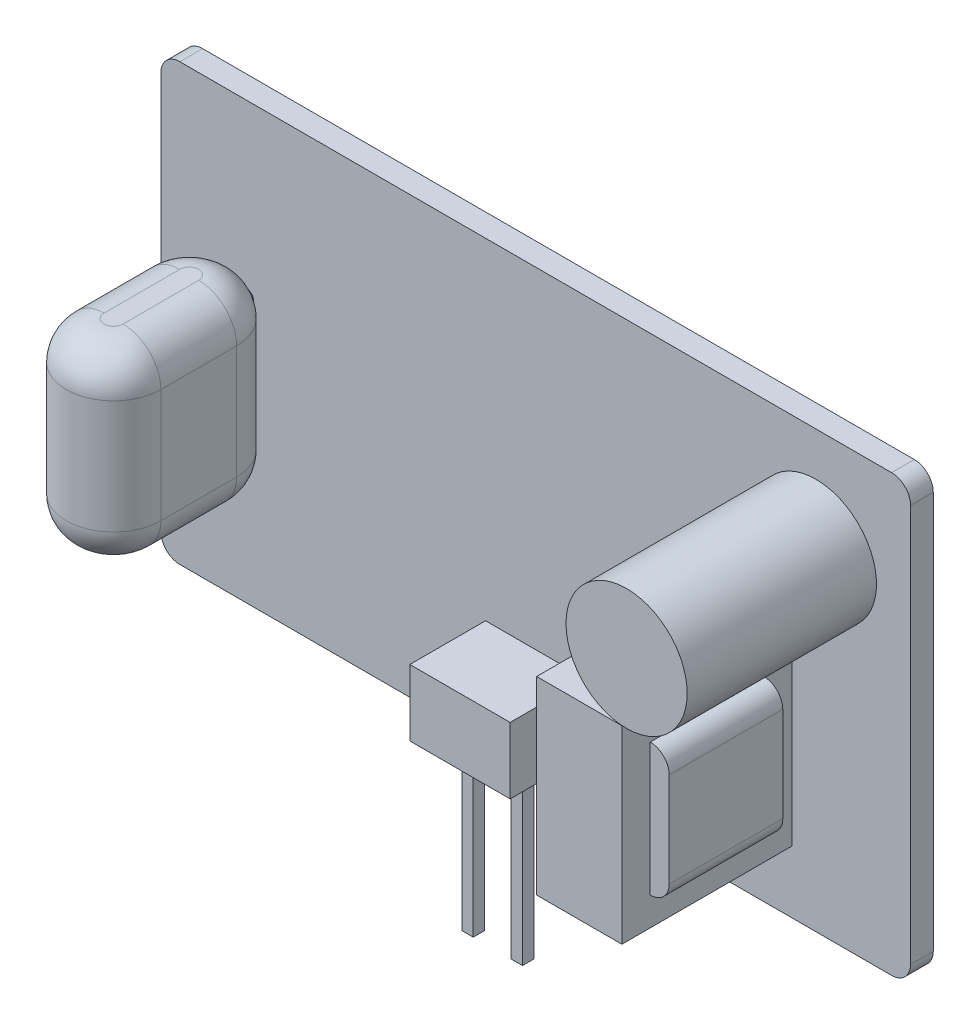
ISO-10303-21;
HEADER;
FILE_DESCRIPTION(('STEP AP214'),'2;1');
FILE_NAME('part.step','',(''),(''),'','','');
FILE_SCHEMA(('AUTOMOTIVE_DESIGN { 1 0 10303 214 1 1 1 1 }'));
ENDSEC;
DATA;
#1=APPLICATION_CONTEXT('core data for automotive mechanical design processes');
#2=APPLICATION_PROTOCOL_DEFINITION('international standard','automotive_design',2000,#1);
#3=PRODUCT_CONTEXT('',#1,'mechanical');
#4=PRODUCT('Part','Part','',(#3));
#5=PRODUCT_RELATED_PRODUCT_CATEGORY('part','',(#4));
#6=PRODUCT_DEFINITION_FORMATION('','',#4);
#7=PRODUCT_DEFINITION_CONTEXT('part definition',#1,'design');
#8=PRODUCT_DEFINITION('design','',#6,#7);
#9=PRODUCT_DEFINITION_SHAPE('','',#8);
#10=(LENGTH_UNIT() NAMED_UNIT(*) SI_UNIT(.MILLI.,.METRE.));
#11=(NAMED_UNIT(*) PLANE_ANGLE_UNIT() SI_UNIT($,.RADIAN.));
#12=(NAMED_UNIT(*) SI_UNIT($,.STERADIAN.) SOLID_ANGLE_UNIT());
#13=UNCERTAINTY_MEASURE_WITH_UNIT(LENGTH_MEASURE(1.E-05),#10,'distance_accuracy_value','');
#14=(GEOMETRIC_REPRESENTATION_CONTEXT(3) GLOBAL_UNCERTAINTY_ASSIGNED_CONTEXT((#13)) GLOBAL_UNIT_ASSIGNED_CONTEXT((#10,
#11,#12)) REPRESENTATION_CONTEXT('',''));
#15=CARTESIAN_POINT('',(0.,0.,0.));
#16=DIRECTION('',(0.,0.,1.));
#17=DIRECTION('',(1.,0.,0.));
#18=AXIS2_PLACEMENT_3D('',#15,#16,#17);
#19=CARTESIAN_POINT('',(-15.3,5.,4.2));
#20=DIRECTION('',(0.,-1.,0.));
#21=DIRECTION('',(0.,0.,-1.));
#22=AXIS2_PLACEMENT_3D('',#19,#20,#21);
#23=CYLINDRICAL_SURFACE('',#22,2.5);
#24=DIRECTION('',(0.,-1.,0.));
#25=VECTOR('',#24,1.);
#26=CARTESIAN_POINT('',(-17.8,5.,4.2));
#27=LINE('',#26,#25);
#28=CARTESIAN_POINT('',(-17.8,3.,4.2));
#29=VERTEX_POINT('',#28);
#30=CARTESIAN_POINT('',(-17.8,-3.,4.2));
#31=VERTEX_POINT('',#30);
#32=EDGE_CURVE('E319',#29,#31,#27,.T.);
#33=ORIENTED_EDGE('',*,*,#32,.F.);
#34=CARTESIAN_POINT('',(-15.3,3.,4.2));
#35=DIRECTION('',(0.,1.,0.));
#36=DIRECTION('',(0.,0.,1.));
#37=AXIS2_PLACEMENT_3D('',#34,#35,#36);
#38=CIRCLE('',#37,2.5);
#39=CARTESIAN_POINT('',(-12.8,3.,4.2));
#40=VERTEX_POINT('',#39);
#41=EDGE_CURVE('E335',#29,#40,#38,.F.);
#42=ORIENTED_EDGE('',*,*,#41,.T.);
#43=DIRECTION('',(0.,-1.,0.));
#44=VECTOR('',#43,1.);
#45=CARTESIAN_POINT('',(-12.8,5.,4.2));
#46=LINE('',#45,#44);
#47=CARTESIAN_POINT('',(-12.8,-3.,4.2));
#48=VERTEX_POINT('',#47);
#49=EDGE_CURVE('E360',#40,#48,#46,.T.);
#50=ORIENTED_EDGE('',*,*,#49,.T.);
#51=CARTESIAN_POINT('',(-15.3,-3.,4.2));
#52=DIRECTION('',(0.,1.,0.));
#53=DIRECTION('',(0.,0.,1.));
#54=AXIS2_PLACEMENT_3D('',#51,#52,#53);
#55=CIRCLE('',#54,2.5);
#56=EDGE_CURVE('E332',#48,#31,#55,.T.);
#57=ORIENTED_EDGE('',*,*,#56,.T.);
#58=EDGE_LOOP('',(#33,#42,#50,#57));
#59=FACE_BOUND('',#58,.T.);
#60=CARTESIAN_POINT('',(-15.7,2.5,1.73220746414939));
#61=CARTESIAN_POINT('',(-15.6999990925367,2.4776866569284,1.73220707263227));
#62=CARTESIAN_POINT('',(-15.698126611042,2.45536081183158,1.73190155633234));
#63=CARTESIAN_POINT('',(-15.6906888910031,2.41133463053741,1.73071349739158));
#64=CARTESIAN_POINT('',(-15.6851201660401,2.38963490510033,1.72983040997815));
#65=CARTESIAN_POINT('',(-15.6704619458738,2.34750453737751,1.72758972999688));
#66=CARTESIAN_POINT('',(-15.6613752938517,2.32707288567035,1.72623252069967));
#67=CARTESIAN_POINT('',(-15.639946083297,2.28802670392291,1.72319697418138));
#68=CARTESIAN_POINT('',(-15.6276039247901,2.26941195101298,1.72151867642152));
#69=CARTESIAN_POINT('',(-15.5998942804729,2.23435621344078,1.71801299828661));
#70=CARTESIAN_POINT('',(-15.5845029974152,2.21793414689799,1.71618451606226));
#71=CARTESIAN_POINT('',(-15.5511834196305,2.18789410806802,1.71259429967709));
#72=CARTESIAN_POINT('',(-15.5332549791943,2.17427629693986,1.71083256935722));
#73=CARTESIAN_POINT('',(-15.4952479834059,2.15016080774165,1.70756274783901));
#74=CARTESIAN_POINT('',(-15.4751581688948,2.13968066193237,1.70605610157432));
#75=CARTESIAN_POINT('',(-15.4334751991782,2.12225061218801,1.70347844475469));
#76=CARTESIAN_POINT('',(-15.4118821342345,2.11530049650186,1.70240740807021));
#77=CARTESIAN_POINT('',(-15.3680008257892,2.10518545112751,1.70082942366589));
#78=CARTESIAN_POINT('',(-15.3457200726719,2.10198877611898,1.70031774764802));
#79=CARTESIAN_POINT('',(-15.3009329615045,2.09937269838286,1.6998999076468));
#80=CARTESIAN_POINT('',(-15.2784266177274,2.09995305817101,1.69999370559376));
#81=CARTESIAN_POINT('',(-15.2340440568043,2.104849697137,1.70077248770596));
#82=CARTESIAN_POINT('',(-15.2121639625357,2.10913181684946,1.70145206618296));
#83=CARTESIAN_POINT('',(-15.1694369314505,2.12125670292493,1.70332002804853));
#84=CARTESIAN_POINT('',(-15.1485900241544,2.12909957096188,1.70450842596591));
#85=CARTESIAN_POINT('',(-15.1084188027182,2.14815769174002,1.70726973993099));
#86=CARTESIAN_POINT('',(-15.0891013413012,2.15938714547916,1.70884426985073));
#87=CARTESIAN_POINT('',(-15.0526120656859,2.1848892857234,1.71220268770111));
#88=CARTESIAN_POINT('',(-15.0354404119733,2.19916219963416,1.71398659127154));
#89=CARTESIAN_POINT('',(-15.0035285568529,2.23053591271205,1.71758868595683));
#90=CARTESIAN_POINT('',(-14.9888176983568,2.24766655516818,1.71940703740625));
#91=CARTESIAN_POINT('',(-14.9624746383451,2.28416855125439,1.72285372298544));
#92=CARTESIAN_POINT('',(-14.9508424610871,2.30353992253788,1.72448205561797));
#93=CARTESIAN_POINT('',(-14.9309819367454,2.3440061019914,1.72736436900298));
#94=CARTESIAN_POINT('',(-14.9227569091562,2.36510256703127,1.72861798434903));
#95=CARTESIAN_POINT('',(-14.9099752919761,2.40840212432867,1.73060271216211));
#96=CARTESIAN_POINT('',(-14.905418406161,2.43060512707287,1.73133386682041));
#97=CARTESIAN_POINT('',(-14.9001433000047,2.47522556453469,1.73218279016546));
#98=CARTESIAN_POINT('',(-14.8993833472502,2.49763794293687,1.7323072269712));
#99=CARTESIAN_POINT('',(-14.9016126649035,2.54226979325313,1.73194636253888));
#100=CARTESIAN_POINT('',(-14.9046018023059,2.5644892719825,1.73146108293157));
#101=CARTESIAN_POINT('',(-14.9142089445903,2.60797338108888,1.72994161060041));
#102=CARTESIAN_POINT('',(-14.9208058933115,2.62924278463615,1.72891060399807));
#103=CARTESIAN_POINT('',(-14.9374193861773,2.67037407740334,1.72641850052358));
#104=CARTESIAN_POINT('',(-14.947436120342,2.69023588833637,1.72495737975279));
#105=CARTESIAN_POINT('',(-14.9707040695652,2.72817447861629,1.72175409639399));
#106=CARTESIAN_POINT('',(-14.9839821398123,2.74623459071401,1.72000964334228));
#107=CARTESIAN_POINT('',(-15.0133587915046,2.77988521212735,1.71644303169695));
#108=CARTESIAN_POINT('',(-15.0294575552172,2.79547556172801,1.7146208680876));
#109=CARTESIAN_POINT('',(-15.0642030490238,2.82389545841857,1.71108315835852));
#110=CARTESIAN_POINT('',(-15.0828726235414,2.83669724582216,1.70936879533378));
#111=CARTESIAN_POINT('',(-15.1221216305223,2.8589826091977,1.70625858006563));
#112=CARTESIAN_POINT('',(-15.1427010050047,2.86846628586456,1.7048627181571));
#113=CARTESIAN_POINT('',(-15.1851012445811,2.88380254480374,1.70255194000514));
#114=CARTESIAN_POINT('',(-15.2069166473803,2.8896699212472,1.70163506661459));
#115=CARTESIAN_POINT('',(-15.251238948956,2.8976547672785,1.70037732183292));
#116=CARTESIAN_POINT('',(-15.2737457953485,2.8997725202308,1.7000364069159));
#117=CARTESIAN_POINT('',(-15.3185436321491,2.90019035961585,1.69996953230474));
#118=CARTESIAN_POINT('',(-15.3408342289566,2.89853277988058,1.7002367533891));
#119=CARTESIAN_POINT('',(-15.3848152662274,2.89153823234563,1.70134227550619));
#120=CARTESIAN_POINT('',(-15.406505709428,2.8862012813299,1.70218057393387));
#121=CARTESIAN_POINT('',(-15.4486564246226,2.87201523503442,1.70433444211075));
#122=CARTESIAN_POINT('',(-15.469117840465,2.86316946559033,1.70564955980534));
#123=CARTESIAN_POINT('',(-15.5082726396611,2.84222150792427,1.70861314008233));
#124=CARTESIAN_POINT('',(-15.5269659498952,2.83011918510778,1.71026161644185));
#125=CARTESIAN_POINT('',(-15.5622677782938,2.8028503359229,1.7137309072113));
#126=CARTESIAN_POINT('',(-15.5788521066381,2.78765269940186,1.71555336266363));
#127=CARTESIAN_POINT('',(-15.6092502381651,2.7546900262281,1.71915353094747));
#128=CARTESIAN_POINT('',(-15.6230633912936,2.73692438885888,1.72093123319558));
#129=CARTESIAN_POINT('',(-15.6476083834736,2.69919416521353,1.72425298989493));
#130=CARTESIAN_POINT('',(-15.6583197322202,2.67921610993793,1.72579546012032));
#131=CARTESIAN_POINT('',(-15.6762183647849,2.63772834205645,1.72845345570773));
#132=CARTESIAN_POINT('',(-15.6834092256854,2.61622020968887,1.72956941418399));
#133=CARTESIAN_POINT('',(-15.6924719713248,2.57885240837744,1.73099625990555));
#134=CARTESIAN_POINT('',(-15.6952905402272,2.56322094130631,1.73144798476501));
#135=CARTESIAN_POINT('',(-15.6990548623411,2.53172842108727,1.73205372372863));
#136=CARTESIAN_POINT('',(-15.7000006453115,2.51586737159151,1.73220774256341));
#137=CARTESIAN_POINT('',(-15.7,2.5,1.73220746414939));
#138=B_SPLINE_CURVE_WITH_KNOTS('',3,(#60,#61,#62,#63,#64,#65,#66,#67,#68,#69,#70,#71,#72,#73,
#74,#75,#76,#77,#78,#79,#80,#81,#82,#83,#84,#85,#86,#87,#88,#89,#90,#91,#92,#93,#94,#95,#96,#97,
#98,#99,#100,#101,#102,#103,#104,#105,#106,#107,#108,#109,#110,#111,#112,#113,#114,#115,#116,
#117,#118,#119,#120,#121,#122,#123,#124,#125,#126,#127,#128,#129,#130,#131,#132,#133,#134,#135,
#136,#137),.UNSPECIFIED.,.T.,.F.,(4,2,2,2,2,2,2,2,2,2,2,2,2,2,2,2,2,2,2,2,2,2,2,2,2,2,2,2,2,2,2,
2,2,2,2,2,2,2,4),(0.,0.0668820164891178,0.133827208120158,0.200718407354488,0.267601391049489,
0.335028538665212,0.402459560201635,0.470260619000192,0.538057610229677,0.605276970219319,
0.672492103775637,0.739093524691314,0.80569684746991,0.872583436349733,0.939475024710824,
1.00711476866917,1.0747550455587,1.14246106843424,1.21016162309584,1.27711641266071,
1.34406882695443,1.41063459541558,1.4772040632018,1.54434123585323,1.61148274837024,
1.67926485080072,1.7470448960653,1.81454578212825,1.88204156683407,1.94878423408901,
2.01552659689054,2.08220584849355,2.14888785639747,2.21627644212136,2.28368081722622,
2.35152080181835,2.41929171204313,2.46685332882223,2.5144141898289),.UNSPECIFIED.);
#139=CARTESIAN_POINT('',(-15.7,2.5,1.73220746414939));
#140=VERTEX_POINT('',#139);
#141=EDGE_CURVE('E373',#140,#140,#138,.T.);
#142=ORIENTED_EDGE('',*,*,#141,.T.);
#143=EDGE_LOOP('',(#142));
#144=FACE_BOUND('',#143,.T.);
#145=CARTESIAN_POINT('',(-15.3,-2.1,1.7));
#146=CARTESIAN_POINT('',(-15.2776845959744,-2.10000090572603,1.70000037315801));
#147=CARTESIAN_POINT('',(-15.2553566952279,-2.10187372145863,1.70030190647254));
#148=CARTESIAN_POINT('',(-15.2113262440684,-2.10931288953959,1.70147575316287));
#149=CARTESIAN_POINT('',(-15.189624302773,-2.11488272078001,1.70234860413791));
#150=CARTESIAN_POINT('',(-15.1474892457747,-2.12954417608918,1.70456710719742));
#151=CARTESIAN_POINT('',(-15.1270551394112,-2.13863300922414,1.70591238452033));
#152=CARTESIAN_POINT('',(-15.0880048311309,-2.16006735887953,1.70892752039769));
#153=CARTESIAN_POINT('',(-15.0693884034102,-2.1724124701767,1.71059733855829));
#154=CARTESIAN_POINT('',(-15.0343345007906,-2.20012512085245,1.71409271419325));
#155=CARTESIAN_POINT('',(-15.0179154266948,-2.21551579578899,1.71591939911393));
#156=CARTESIAN_POINT('',(-14.9878811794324,-2.24883289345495,1.71951392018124));
#157=CARTESIAN_POINT('',(-14.9742661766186,-2.26675947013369,1.72128175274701));
#158=CARTESIAN_POINT('',(-14.9501536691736,-2.30476477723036,1.72456933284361));
#159=CARTESIAN_POINT('',(-14.9396742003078,-2.32485508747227,1.72608762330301));
#160=CARTESIAN_POINT('',(-14.9222455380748,-2.36653913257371,1.72868866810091));
#161=CARTESIAN_POINT('',(-14.9152961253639,-2.38813277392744,1.72977144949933));
#162=CARTESIAN_POINT('',(-14.9051824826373,-2.43201607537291,1.73136771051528));
#163=CARTESIAN_POINT('',(-14.9019865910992,-2.45429826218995,1.73188594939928));
#164=CARTESIAN_POINT('',(-14.8993725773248,-2.49908819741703,1.73230886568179));
#165=CARTESIAN_POINT('',(-14.8999542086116,-2.52159593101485,1.73221358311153));
#166=CARTESIAN_POINT('',(-14.9048529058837,-2.56597300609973,1.73142457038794));
#167=CARTESIAN_POINT('',(-14.9091345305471,-2.58784637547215,1.73073651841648));
#168=CARTESIAN_POINT('',(-14.9212561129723,-2.63056021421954,1.72884837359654));
#169=CARTESIAN_POINT('',(-14.9290961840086,-2.65140065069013,1.72764826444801));
#170=CARTESIAN_POINT('',(-14.9481484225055,-2.69156385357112,1.72486503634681));
#171=CARTESIAN_POINT('',(-14.9593754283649,-2.71087945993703,1.72328023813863));
#172=CARTESIAN_POINT('',(-14.9848722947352,-2.74736605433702,1.71990738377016));
#173=CARTESIAN_POINT('',(-14.9991423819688,-2.7645368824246,1.71811931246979));
#174=CARTESIAN_POINT('',(-15.0305140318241,-2.79645176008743,1.71451637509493));
#175=CARTESIAN_POINT('',(-15.0476460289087,-2.81116590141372,1.71270143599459));
#176=CARTESIAN_POINT('',(-15.0841519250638,-2.83751494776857,1.70926814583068));
#177=CARTESIAN_POINT('',(-15.1035258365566,-2.84914983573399,1.7076497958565));
#178=CARTESIAN_POINT('',(-15.1439928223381,-2.86901233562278,1.70478998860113));
#179=CARTESIAN_POINT('',(-15.1650871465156,-2.87723744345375,1.70354880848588));
#180=CARTESIAN_POINT('',(-15.2083820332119,-2.89001987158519,1.7015854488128));
#181=CARTESIAN_POINT('',(-15.2305825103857,-2.8945774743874,1.70086322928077));
#182=CARTESIAN_POINT('',(-15.2752015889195,-2.89985529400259,1.70002450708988));
#183=CARTESIAN_POINT('',(-15.2976152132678,-2.90061659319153,1.69990152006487));
#184=CARTESIAN_POINT('',(-15.3422498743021,-2.89838952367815,1.70025740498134));
#185=CARTESIAN_POINT('',(-15.3644709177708,-2.89540128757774,1.7007362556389));
#186=CARTESIAN_POINT('',(-15.407963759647,-2.88579414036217,1.70223799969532));
#187=CARTESIAN_POINT('',(-15.4292401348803,-2.87919543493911,1.70325786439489));
#188=CARTESIAN_POINT('',(-15.4703845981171,-2.86257610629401,1.70572770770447));
#189=CARTESIAN_POINT('',(-15.4902526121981,-2.85255530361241,1.70717770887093));
#190=CARTESIAN_POINT('',(-15.5281957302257,-2.82928120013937,1.71036295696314));
#191=CARTESIAN_POINT('',(-15.546254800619,-2.81600207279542,1.71210044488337));
#192=CARTESIAN_POINT('',(-15.579902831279,-2.78662396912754,1.71566080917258));
#193=CARTESIAN_POINT('',(-15.5954916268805,-2.77052480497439,1.71748369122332));
#194=CARTESIAN_POINT('',(-15.6239077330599,-2.73577992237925,1.72103019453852));
#195=CARTESIAN_POINT('',(-15.6367073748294,-2.71711144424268,1.72275270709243));
#196=CARTESIAN_POINT('',(-15.6589889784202,-2.67786524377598,1.7258831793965));
#197=CARTESIAN_POINT('',(-15.6684710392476,-2.65728757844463,1.72729114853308));
#198=CARTESIAN_POINT('',(-15.6838063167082,-2.61488660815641,1.72962491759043));
#199=CARTESIAN_POINT('',(-15.689673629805,-2.59306850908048,1.73055258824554));
#200=CARTESIAN_POINT('',(-15.6976574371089,-2.54874048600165,1.73182553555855));
#201=CARTESIAN_POINT('',(-15.6997742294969,-2.52623061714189,1.73217085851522));
#202=CARTESIAN_POINT('',(-15.7001890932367,-2.48143410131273,1.73223812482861));
#203=CARTESIAN_POINT('',(-15.6985306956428,-2.4591478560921,1.73196717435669));
#204=CARTESIAN_POINT('',(-15.6915360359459,-2.41517573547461,1.73084794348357));
#205=CARTESIAN_POINT('',(-15.6861997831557,-2.39348985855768,1.72999966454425));
#206=CARTESIAN_POINT('',(-15.6720170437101,-2.35134892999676,1.72782396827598));
#207=CARTESIAN_POINT('',(-15.6631740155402,-2.33089268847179,1.72649702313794));
#208=CARTESIAN_POINT('',(-15.6422331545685,-2.29174710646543,1.72351300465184));
#209=CARTESIAN_POINT('',(-15.630135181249,-2.2730578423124,1.72185591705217));
#210=CARTESIAN_POINT('',(-15.6028713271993,-2.23775628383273,1.71837566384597));
#211=CARTESIAN_POINT('',(-15.5876733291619,-2.22116895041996,1.71655087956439));
#212=CARTESIAN_POINT('',(-15.5547086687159,-2.19076492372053,1.71295399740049));
#213=CARTESIAN_POINT('',(-15.536941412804,-2.17694887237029,1.71118191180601));
#214=CARTESIAN_POINT('',(-15.4992096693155,-2.15240050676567,1.7078771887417));
#215=CARTESIAN_POINT('',(-15.479232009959,-2.14168822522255,1.70634613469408));
#216=CARTESIAN_POINT('',(-15.4377450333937,-2.1237877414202,1.70371142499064));
#217=CARTESIAN_POINT('',(-15.416237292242,-2.11659597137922,1.70260733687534));
#218=CARTESIAN_POINT('',(-15.3788671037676,-2.10753085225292,1.70119648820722));
#219=CARTESIAN_POINT('',(-15.3632326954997,-2.10471121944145,1.70075016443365));
#220=CARTESIAN_POINT('',(-15.3317342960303,-2.10094548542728,1.70015178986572));
#221=CARTESIAN_POINT('',(-15.3158703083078,-2.09999935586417,1.69999973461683));
#222=CARTESIAN_POINT('',(-15.3,-2.1,1.7));
#223=B_SPLINE_CURVE_WITH_KNOTS('',3,(#145,#146,#147,#148,#149,#150,#151,#152,#153,#154,#155,
#156,#157,#158,#159,#160,#161,#162,#163,#164,#165,#166,#167,#168,#169,#170,#171,#172,#173,#174,
#175,#176,#177,#178,#179,#180,#181,#182,#183,#184,#185,#186,#187,#188,#189,#190,#191,#192,#193,
#194,#195,#196,#197,#198,#199,#200,#201,#202,#203,#204,#205,#206,#207,#208,#209,#210,#211,#212,
#213,#214,#215,#216,#217,#218,#219,#220,#221,#222),.UNSPECIFIED.,.T.,.F.,(4,2,2,2,2,2,2,2,2,2,2,
2,2,2,2,2,2,2,2,2,2,2,2,2,2,2,2,2,2,2,2,2,2,2,2,2,2,2,4),(0.,0.0668882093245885,
0.133839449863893,0.20073769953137,0.267627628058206,0.335046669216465,0.402469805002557,
0.470273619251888,0.538073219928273,0.605296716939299,0.672515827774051,0.739098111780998,
0.805682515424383,0.872562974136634,0.939448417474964,1.00709662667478,1.07474521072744,
1.14244338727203,1.21013634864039,1.27709514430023,1.34405157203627,1.4106370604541,
1.47722604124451,1.54436091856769,1.61150026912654,1.6792780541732,1.74705381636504,
1.81456357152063,1.88206795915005,1.94879791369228,2.01552769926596,2.08219183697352,
2.14885885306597,2.21625526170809,2.28366726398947,2.35150513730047,2.41927411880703,
2.46684451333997,2.5144141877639),.UNSPECIFIED.);
#224=CARTESIAN_POINT('',(-15.3,-2.1,1.7));
#225=VERTEX_POINT('',#224);
#226=EDGE_CURVE('E41',#225,#225,#223,.T.);
#227=ORIENTED_EDGE('',*,*,#226,.F.);
#228=EDGE_LOOP('',(#227));
#229=FACE_BOUND('',#228,.T.);
#230=ADVANCED_FACE('F37',(#59,#144,#229),#23,.T.);
#231=CARTESIAN_POINT('',(-2.65000000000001,-9.5,5.2));
#232=DIRECTION('',(0.,1.,0.));
#233=DIRECTION('',(0.,0.,1.));
#234=AXIS2_PLACEMENT_3D('',#231,#232,#233);
#235=PLANE('',#234);
#236=DIRECTION('',(0.,0.,1.));
#237=VECTOR('',#236,1.);
#238=CARTESIAN_POINT('',(1.6,-9.5,3.5));
#239=LINE('',#238,#237);
#240=CARTESIAN_POINT('',(1.6,-9.5,2.9));
#241=VERTEX_POINT('',#240);
#242=CARTESIAN_POINT('',(1.6,-9.5,3.5));
#243=VERTEX_POINT('',#242);
#244=EDGE_CURVE('E539',#241,#243,#239,.T.);
#245=ORIENTED_EDGE('',*,*,#244,.F.);
#246=DIRECTION('',(1.,0.,0.));
#247=VECTOR('',#246,1.);
#248=CARTESIAN_POINT('',(1.,-9.5,2.9));
#249=LINE('',#248,#247);
#250=CARTESIAN_POINT('',(1.,-9.5,2.9));
#251=VERTEX_POINT('',#250);
#252=EDGE_CURVE('E544',#251,#241,#249,.T.);
#253=ORIENTED_EDGE('',*,*,#252,.F.);
#254=DIRECTION('',(0.,0.,-1.));
#255=VECTOR('',#254,1.);
#256=CARTESIAN_POINT('',(1.,-9.5,3.5));
#257=LINE('',#256,#255);
#258=CARTESIAN_POINT('',(1.,-9.5,3.5));
#259=VERTEX_POINT('',#258);
#260=EDGE_CURVE('E556',#259,#251,#257,.T.);
#261=ORIENTED_EDGE('',*,*,#260,.F.);
#262=DIRECTION('',(-1.,0.,0.));
#263=VECTOR('',#262,1.);
#264=CARTESIAN_POINT('',(1.,-9.5,3.5));
#265=LINE('',#264,#263);
#266=EDGE_CURVE('E553',#243,#259,#265,.T.);
#267=ORIENTED_EDGE('',*,*,#266,.F.);
#268=EDGE_LOOP('',(#245,#253,#261,#267));
#269=FACE_BOUND('',#268,.T.);
#270=DIRECTION('',(1.,0.,0.));
#271=VECTOR('',#270,1.);
#272=CARTESIAN_POINT('',(-2.65000000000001,-9.5,1.2));
#273=LINE('',#272,#271);
#274=CARTESIAN_POINT('',(-2.65000000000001,-9.50000000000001,1.2));
#275=VERTEX_POINT('',#274);
#276=CARTESIAN_POINT('',(2.64999999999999,-9.5,1.2));
#277=VERTEX_POINT('',#276);
#278=EDGE_CURVE('E577',#275,#277,#273,.T.);
#279=ORIENTED_EDGE('',*,*,#278,.T.);
#280=DIRECTION('',(0.,0.,-1.));
#281=VECTOR('',#280,1.);
#282=CARTESIAN_POINT('',(2.64999999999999,-9.5,5.2));
#283=LINE('',#282,#281);
#284=CARTESIAN_POINT('',(2.64999999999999,-9.5,5.2));
#285=VERTEX_POINT('',#284);
#286=EDGE_CURVE('E583',#285,#277,#283,.T.);
#287=ORIENTED_EDGE('',*,*,#286,.F.);
#288=DIRECTION('',(1.,0.,0.));
#289=VECTOR('',#288,1.);
#290=CARTESIAN_POINT('',(-2.65000000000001,-9.5,5.2));
#291=LINE('',#290,#289);
#292=CARTESIAN_POINT('',(-2.65000000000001,-9.5,5.2));
#293=VERTEX_POINT('',#292);
#294=EDGE_CURVE('E581',#293,#285,#291,.T.);
#295=ORIENTED_EDGE('',*,*,#294,.F.);
#296=DIRECTION('',(0.,0.,-1.));
#297=VECTOR('',#296,1.);
#298=CARTESIAN_POINT('',(-2.65000000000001,-9.5,5.2));
#299=LINE('',#298,#297);
#300=EDGE_CURVE('E596',#293,#275,#299,.T.);
#301=ORIENTED_EDGE('',*,*,#300,.T.);
#302=EDGE_LOOP('',(#279,#287,#295,#301));
#303=FACE_BOUND('',#302,.T.);
#304=DIRECTION('',(0.,0.,1.));
#305=VECTOR('',#304,1.);
#306=CARTESIAN_POINT('',(-1.,-9.5,3.5));
#307=LINE('',#306,#305);
#308=CARTESIAN_POINT('',(-1.,-9.5,2.9));
#309=VERTEX_POINT('',#308);
#310=CARTESIAN_POINT('',(-1.,-9.5,3.5));
#311=VERTEX_POINT('',#310);
#312=EDGE_CURVE('E511',#309,#311,#307,.T.);
#313=ORIENTED_EDGE('',*,*,#312,.F.);
#314=DIRECTION('',(1.,0.,0.));
#315=VECTOR('',#314,1.);
#316=CARTESIAN_POINT('',(-1.,-9.5,2.9));
#317=LINE('',#316,#315);
#318=CARTESIAN_POINT('',(-1.6,-9.5,2.9));
#319=VERTEX_POINT('',#318);
#320=EDGE_CURVE('E525',#319,#309,#317,.T.);
#321=ORIENTED_EDGE('',*,*,#320,.F.);
#322=DIRECTION('',(0.,0.,-1.));
#323=VECTOR('',#322,1.);
#324=CARTESIAN_POINT('',(-1.6,-9.5,3.5));
#325=LINE('',#324,#323);
#326=CARTESIAN_POINT('',(-1.6,-9.5,3.5));
#327=VERTEX_POINT('',#326);
#328=EDGE_CURVE('E63',#327,#319,#325,.T.);
#329=ORIENTED_EDGE('',*,*,#328,.F.);
#330=DIRECTION('',(-1.,0.,0.));
#331=VECTOR('',#330,1.);
#332=CARTESIAN_POINT('',(-1.,-9.5,3.5));
#333=LINE('',#332,#331);
#334=EDGE_CURVE('E58',#311,#327,#333,.T.);
#335=ORIENTED_EDGE('',*,*,#334,.F.);
#336=EDGE_LOOP('',(#313,#321,#329,#335));
#337=FACE_BOUND('',#336,.T.);
#338=ADVANCED_FACE('F426',(#269,#303,#337),#235,.F.);
#339=CARTESIAN_POINT('',(18.8,10.5,1.2));
#340=DIRECTION('',(0.,0.,-1.));
#341=DIRECTION('',(-1.,0.,0.));
#342=AXIS2_PLACEMENT_3D('',#339,#340,#341);
#343=PLANE('',#342);
#344=CARTESIAN_POINT('',(-15.3,-2.5,1.2));
#345=DIRECTION('',(0.,0.,-1.));
#346=DIRECTION('',(-1.,0.,0.));
#347=AXIS2_PLACEMENT_3D('',#344,#345,#346);
#348=CIRCLE('',#347,0.399999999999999);
#349=CARTESIAN_POINT('',(-15.6999999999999,-2.5,1.2));
#350=VERTEX_POINT('',#349);
#351=EDGE_CURVE('E12',#350,#350,#348,.F.);
#352=ORIENTED_EDGE('',*,*,#351,.F.);
#353=EDGE_LOOP('',(#352));
#354=FACE_BOUND('',#353,.T.);
#355=CARTESIAN_POINT('',(-15.3,2.5,1.2));
#356=DIRECTION('',(0.,0.,-1.));
#357=DIRECTION('',(-1.,0.,0.));
#358=AXIS2_PLACEMENT_3D('',#355,#356,#357);
#359=CIRCLE('',#358,0.399999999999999);
#360=CARTESIAN_POINT('',(-15.7,2.5,1.2));
#361=VERTEX_POINT('',#360);
#362=EDGE_CURVE('E382',#361,#361,#359,.F.);
#363=ORIENTED_EDGE('',*,*,#362,.F.);
#364=EDGE_LOOP('',(#363));
#365=FACE_BOUND('',#364,.T.);
#366=DIRECTION('',(-1.,0.,0.));
#367=VECTOR('',#366,1.);
#368=CARTESIAN_POINT('',(13.55,1.79999999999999,1.2));
#369=LINE('',#368,#367);
#370=CARTESIAN_POINT('',(13.55,1.79999999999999,1.2));
#371=VERTEX_POINT('',#370);
#372=CARTESIAN_POINT('',(9.05,1.79999999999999,1.2));
#373=VERTEX_POINT('',#372);
#374=EDGE_CURVE('E699',#371,#373,#369,.T.);
#375=ORIENTED_EDGE('',*,*,#374,.F.);
#376=DIRECTION('',(0.,1.,0.));
#377=VECTOR('',#376,1.);
#378=CARTESIAN_POINT('',(13.55,1.79999999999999,1.2));
#379=LINE('',#378,#377);
#380=CARTESIAN_POINT('',(13.55,-8.20000000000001,1.2));
#381=VERTEX_POINT('',#380);
#382=EDGE_CURVE('E673',#381,#371,#379,.T.);
#383=ORIENTED_EDGE('',*,*,#382,.F.);
#384=DIRECTION('',(-1.,0.,0.));
#385=VECTOR('',#384,1.);
#386=CARTESIAN_POINT('',(13.55,-8.20000000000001,1.2));
#387=LINE('',#386,#385);
#388=CARTESIAN_POINT('',(9.05,-8.20000000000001,1.2));
#389=VERTEX_POINT('',#388);
#390=EDGE_CURVE('E684',#381,#389,#387,.T.);
#391=ORIENTED_EDGE('',*,*,#390,.T.);
#392=DIRECTION('',(0.,1.,0.));
#393=VECTOR('',#392,1.);
#394=CARTESIAN_POINT('',(9.05,1.79999999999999,1.2));
#395=LINE('',#394,#393);
#396=EDGE_CURVE('E662',#389,#373,#395,.T.);
#397=ORIENTED_EDGE('',*,*,#396,.T.);
#398=EDGE_LOOP('',(#375,#383,#391,#397));
#399=FACE_BOUND('',#398,.T.);
#400=CARTESIAN_POINT('',(14.8,6.,1.2));
#401=DIRECTION('',(0.,0.,-1.));
#402=DIRECTION('',(-1.,0.,0.));
#403=AXIS2_PLACEMENT_3D('',#400,#401,#402);
#404=CIRCLE('',#403,3.2);
#405=CARTESIAN_POINT('',(11.6,6.,1.2));
#406=VERTEX_POINT('',#405);
#407=EDGE_CURVE('E498',#406,#406,#404,.F.);
#408=ORIENTED_EDGE('',*,*,#407,.F.);
#409=EDGE_LOOP('',(#408));
#410=FACE_BOUND('',#409,.T.);
#411=CARTESIAN_POINT('',(18.8,10.5,1.2));
#412=DIRECTION('',(0.,0.,1.));
#413=DIRECTION('',(-1.,0.,0.));
#414=AXIS2_PLACEMENT_3D('',#411,#412,#413);
#415=CIRCLE('',#414,1.);
#416=CARTESIAN_POINT('',(19.8,10.5,1.2));
#417=VERTEX_POINT('',#416);
#418=CARTESIAN_POINT('',(18.8,11.5,1.2));
#419=VERTEX_POINT('',#418);
#420=EDGE_CURVE('E706',#417,#419,#415,.T.);
#421=ORIENTED_EDGE('',*,*,#420,.T.);
#422=DIRECTION('',(-1.,0.,0.));
#423=VECTOR('',#422,1.);
#424=CARTESIAN_POINT('',(-18.8,11.5,1.2));
#425=LINE('',#424,#423);
#426=CARTESIAN_POINT('',(-18.8,11.5,1.2));
#427=VERTEX_POINT('',#426);
#428=EDGE_CURVE('E709',#419,#427,#425,.T.);
#429=ORIENTED_EDGE('',*,*,#428,.T.);
#430=CARTESIAN_POINT('',(-18.8,10.5,1.2));
#431=DIRECTION('',(0.,0.,1.));
#432=DIRECTION('',(-1.,0.,0.));
#433=AXIS2_PLACEMENT_3D('',#430,#431,#432);
#434=CIRCLE('',#433,1.);
#435=CARTESIAN_POINT('',(-19.8,10.5,1.2));
#436=VERTEX_POINT('',#435);
#437=EDGE_CURVE('E712',#427,#436,#434,.T.);
#438=ORIENTED_EDGE('',*,*,#437,.T.);
#439=DIRECTION('',(0.,-1.,0.));
#440=VECTOR('',#439,1.);
#441=CARTESIAN_POINT('',(-19.8,-10.5,1.2));
#442=LINE('',#441,#440);
#443=CARTESIAN_POINT('',(-19.8,-10.5,1.2));
#444=VERTEX_POINT('',#443);
#445=EDGE_CURVE('E714',#436,#444,#442,.T.);
#446=ORIENTED_EDGE('',*,*,#445,.T.);
#447=CARTESIAN_POINT('',(-18.8,-10.5,1.2));
#448=DIRECTION('',(0.,0.,1.));
#449=DIRECTION('',(-1.,0.,0.));
#450=AXIS2_PLACEMENT_3D('',#447,#448,#449);
#451=CIRCLE('',#450,1.);
#452=CARTESIAN_POINT('',(-18.8,-11.5,1.2));
#453=VERTEX_POINT('',#452);
#454=EDGE_CURVE('E716',#444,#453,#451,.T.);
#455=ORIENTED_EDGE('',*,*,#454,.T.);
#456=DIRECTION('',(1.,0.,0.));
#457=VECTOR('',#456,1.);
#458=CARTESIAN_POINT('',(-18.8,-11.5,1.2));
#459=LINE('',#458,#457);
#460=CARTESIAN_POINT('',(18.8,-11.5,1.2));
#461=VERTEX_POINT('',#460);
#462=EDGE_CURVE('E718',#453,#461,#459,.T.);
#463=ORIENTED_EDGE('',*,*,#462,.T.);
#464=CARTESIAN_POINT('',(18.8,-10.5,1.2));
#465=DIRECTION('',(0.,0.,1.));
#466=DIRECTION('',(-1.,0.,0.));
#467=AXIS2_PLACEMENT_3D('',#464,#465,#466);
#468=CIRCLE('',#467,1.);
#469=CARTESIAN_POINT('',(19.8,-10.5,1.2));
#470=VERTEX_POINT('',#469);
#471=EDGE_CURVE('E720',#461,#470,#468,.T.);
#472=ORIENTED_EDGE('',*,*,#471,.T.);
#473=DIRECTION('',(0.,1.,0.));
#474=VECTOR('',#473,1.);
#475=CARTESIAN_POINT('',(19.8,-10.5,1.2));
#476=LINE('',#475,#474);
#477=EDGE_CURVE('E722',#470,#417,#476,.T.);
#478=ORIENTED_EDGE('',*,*,#477,.T.);
#479=EDGE_LOOP('',(#421,#429,#438,#446,#455,#463,#472,#478));
#480=FACE_BOUND('',#479,.T.);
#481=DIRECTION('',(0.,1.,0.));
#482=VECTOR('',#481,1.);
#483=CARTESIAN_POINT('',(2.64999999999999,-6.,1.2));
#484=LINE('',#483,#482);
#485=CARTESIAN_POINT('',(2.64999999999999,-6.,1.2));
#486=VERTEX_POINT('',#485);
#487=EDGE_CURVE('E572',#277,#486,#484,.T.);
#488=ORIENTED_EDGE('',*,*,#487,.F.);
#489=ORIENTED_EDGE('',*,*,#278,.F.);
#490=DIRECTION('',(0.,-1.,0.));
#491=VECTOR('',#490,1.);
#492=CARTESIAN_POINT('',(-2.65000000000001,-6.,1.2));
#493=LINE('',#492,#491);
#494=CARTESIAN_POINT('',(-2.65000000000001,-6.00000000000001,1.2));
#495=VERTEX_POINT('',#494);
#496=EDGE_CURVE('E589',#495,#275,#493,.T.);
#497=ORIENTED_EDGE('',*,*,#496,.F.);
#498=DIRECTION('',(-1.,0.,0.));
#499=VECTOR('',#498,1.);
#500=CARTESIAN_POINT('',(-2.65000000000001,-6.,1.2));
#501=LINE('',#500,#499);
#502=EDGE_CURVE('E586',#486,#495,#501,.T.);
#503=ORIENTED_EDGE('',*,*,#502,.F.);
#504=EDGE_LOOP('',(#488,#489,#497,#503));
#505=FACE_BOUND('',#504,.T.);
#506=ADVANCED_FACE('F780',(#354,#365,#399,#410,#480,#505),#343,.F.);
#507=CARTESIAN_POINT('',(18.8,10.5,1.2));
#508=DIRECTION('',(0.,0.,-1.));
#509=DIRECTION('',(-1.,0.,0.));
#510=AXIS2_PLACEMENT_3D('',#507,#508,#509);
#511=CYLINDRICAL_SURFACE('',#510,1.);
#512=CARTESIAN_POINT('',(18.8,10.5,0.));
#513=DIRECTION('',(0.,0.,1.));
#514=DIRECTION('',(-1.,0.,0.));
#515=AXIS2_PLACEMENT_3D('',#512,#513,#514);
#516=CIRCLE('',#515,1.);
#517=CARTESIAN_POINT('',(19.8,10.5,0.));
#518=VERTEX_POINT('',#517);
#519=CARTESIAN_POINT('',(18.8,11.5,0.));
#520=VERTEX_POINT('',#519);
#521=EDGE_CURVE('E705',#518,#520,#516,.T.);
#522=ORIENTED_EDGE('',*,*,#521,.T.);
#523=DIRECTION('',(0.,0.,-1.));
#524=VECTOR('',#523,1.);
#525=CARTESIAN_POINT('',(18.8,11.5,1.2));
#526=LINE('',#525,#524);
#527=EDGE_CURVE('E502',#419,#520,#526,.T.);
#528=ORIENTED_EDGE('',*,*,#527,.F.);
#529=ORIENTED_EDGE('',*,*,#420,.F.);
#530=DIRECTION('',(0.,0.,-1.));
#531=VECTOR('',#530,1.);
#532=CARTESIAN_POINT('',(19.8,10.5,1.2));
#533=LINE('',#532,#531);
#534=EDGE_CURVE('E724',#417,#518,#533,.T.);
#535=ORIENTED_EDGE('',*,*,#534,.T.);
#536=EDGE_LOOP('',(#522,#528,#529,#535));
#537=FACE_BOUND('',#536,.T.);
#538=ADVANCED_FACE('F39',(#537),#511,.T.);
#539=CARTESIAN_POINT('',(-18.8,11.5,1.2));
#540=DIRECTION('',(0.,-1.,0.));
#541=DIRECTION('',(0.,0.,-1.));
#542=AXIS2_PLACEMENT_3D('',#539,#540,#541);
#543=PLANE('',#542);
#544=DIRECTION('',(-1.,0.,0.));
#545=VECTOR('',#544,1.);
#546=CARTESIAN_POINT('',(-18.8,11.5,0.));
#547=LINE('',#546,#545);
#548=CARTESIAN_POINT('',(-18.8,11.5,0.));
#549=VERTEX_POINT('',#548);
#550=EDGE_CURVE('E727',#520,#549,#547,.T.);
#551=ORIENTED_EDGE('',*,*,#550,.T.);
#552=DIRECTION('',(0.,0.,-1.));
#553=VECTOR('',#552,1.);
#554=CARTESIAN_POINT('',(-18.8,11.5,1.2));
#555=LINE('',#554,#553);
#556=EDGE_CURVE('E507',#427,#549,#555,.T.);
#557=ORIENTED_EDGE('',*,*,#556,.F.);
#558=ORIENTED_EDGE('',*,*,#428,.F.);
#559=ORIENTED_EDGE('',*,*,#527,.T.);
#560=EDGE_LOOP('',(#551,#557,#558,#559));
#561=FACE_BOUND('',#560,.T.);
#562=ADVANCED_FACE('F785',(#561),#543,.F.);
#563=CARTESIAN_POINT('',(-18.8,10.5,1.2));
#564=DIRECTION('',(0.,0.,-1.));
#565=DIRECTION('',(-1.,0.,0.));
#566=AXIS2_PLACEMENT_3D('',#563,#564,#565);
#567=CYLINDRICAL_SURFACE('',#566,1.);
#568=CARTESIAN_POINT('',(-18.8,10.5,0.));
#569=DIRECTION('',(0.,0.,1.));
#570=DIRECTION('',(-1.,0.,0.));
#571=AXIS2_PLACEMENT_3D('',#568,#569,#570);
#572=CIRCLE('',#571,1.);
#573=CARTESIAN_POINT('',(-19.8,10.5,0.));
#574=VERTEX_POINT('',#573);
#575=EDGE_CURVE('E729',#549,#574,#572,.T.);
#576=ORIENTED_EDGE('',*,*,#575,.T.);
#577=DIRECTION('',(0.,0.,-1.));
#578=VECTOR('',#577,1.);
#579=CARTESIAN_POINT('',(-19.8,10.5,1.2));
#580=LINE('',#579,#578);
#581=EDGE_CURVE('E754',#436,#574,#580,.T.);
#582=ORIENTED_EDGE('',*,*,#581,.F.);
#583=ORIENTED_EDGE('',*,*,#437,.F.);
#584=ORIENTED_EDGE('',*,*,#556,.T.);
#585=EDGE_LOOP('',(#576,#582,#583,#584));
#586=FACE_BOUND('',#585,.T.);
#587=ADVANCED_FACE('F761',(#586),#567,.T.);
#588=CARTESIAN_POINT('',(-19.8,-10.5,1.2));
#589=DIRECTION('',(1.,0.,0.));
#590=DIRECTION('',(0.,0.,-1.));
#591=AXIS2_PLACEMENT_3D('',#588,#589,#590);
#592=PLANE('',#591);
#593=DIRECTION('',(0.,-1.,0.));
#594=VECTOR('',#593,1.);
#595=CARTESIAN_POINT('',(-19.8,-10.5,0.));
#596=LINE('',#595,#594);
#597=CARTESIAN_POINT('',(-19.8,-10.5,0.));
#598=VERTEX_POINT('',#597);
#599=EDGE_CURVE('E731',#574,#598,#596,.T.);
#600=ORIENTED_EDGE('',*,*,#599,.T.);
#601=DIRECTION('',(0.,0.,-1.));
#602=VECTOR('',#601,1.);
#603=CARTESIAN_POINT('',(-19.8,-10.5,1.2));
#604=LINE('',#603,#602);
#605=EDGE_CURVE('E751',#444,#598,#604,.T.);
#606=ORIENTED_EDGE('',*,*,#605,.F.);
#607=ORIENTED_EDGE('',*,*,#445,.F.);
#608=ORIENTED_EDGE('',*,*,#581,.T.);
#609=EDGE_LOOP('',(#600,#606,#607,#608));
#610=FACE_BOUND('',#609,.T.);
#611=ADVANCED_FACE('F772',(#610),#592,.F.);
#612=CARTESIAN_POINT('',(-18.8,-10.5,1.2));
#613=DIRECTION('',(0.,0.,-1.));
#614=DIRECTION('',(-1.,0.,0.));
#615=AXIS2_PLACEMENT_3D('',#612,#613,#614);
#616=CYLINDRICAL_SURFACE('',#615,1.);
#617=CARTESIAN_POINT('',(-18.8,-10.5,0.));
#618=DIRECTION('',(0.,0.,1.));
#619=DIRECTION('',(-1.,0.,0.));
#620=AXIS2_PLACEMENT_3D('',#617,#618,#619);
#621=CIRCLE('',#620,1.);
#622=CARTESIAN_POINT('',(-18.8,-11.5,0.));
#623=VERTEX_POINT('',#622);
#624=EDGE_CURVE('E733',#598,#623,#621,.T.);
#625=ORIENTED_EDGE('',*,*,#624,.T.);
#626=DIRECTION('',(0.,0.,-1.));
#627=VECTOR('',#626,1.);
#628=CARTESIAN_POINT('',(-18.8,-11.5,1.2));
#629=LINE('',#628,#627);
#630=EDGE_CURVE('E748',#453,#623,#629,.T.);
#631=ORIENTED_EDGE('',*,*,#630,.F.);
#632=ORIENTED_EDGE('',*,*,#454,.F.);
#633=ORIENTED_EDGE('',*,*,#605,.T.);
#634=EDGE_LOOP('',(#625,#631,#632,#633));
#635=FACE_BOUND('',#634,.T.);
#636=ADVANCED_FACE('F776',(#635),#616,.T.);
#637=CARTESIAN_POINT('',(-18.8,-11.5,1.2));
#638=DIRECTION('',(0.,1.,0.));
#639=DIRECTION('',(0.,0.,1.));
#640=AXIS2_PLACEMENT_3D('',#637,#638,#639);
#641=PLANE('',#640);
#642=DIRECTION('',(1.,0.,0.));
#643=VECTOR('',#642,1.);
#644=CARTESIAN_POINT('',(-18.8,-11.5,0.));
#645=LINE('',#644,#643);
#646=CARTESIAN_POINT('',(18.8,-11.5,0.));
#647=VERTEX_POINT('',#646);
#648=EDGE_CURVE('E735',#623,#647,#645,.T.);
#649=ORIENTED_EDGE('',*,*,#648,.T.);
#650=DIRECTION('',(0.,0.,-1.));
#651=VECTOR('',#650,1.);
#652=CARTESIAN_POINT('',(18.8,-11.5,1.2));
#653=LINE('',#652,#651);
#654=EDGE_CURVE('E745',#461,#647,#653,.T.);
#655=ORIENTED_EDGE('',*,*,#654,.F.);
#656=ORIENTED_EDGE('',*,*,#462,.F.);
#657=ORIENTED_EDGE('',*,*,#630,.T.);
#658=EDGE_LOOP('',(#649,#655,#656,#657));
#659=FACE_BOUND('',#658,.T.);
#660=ADVANCED_FACE('F798',(#659),#641,.F.);
#661=CARTESIAN_POINT('',(18.8,-10.5,1.2));
#662=DIRECTION('',(0.,0.,-1.));
#663=DIRECTION('',(-1.,0.,0.));
#664=AXIS2_PLACEMENT_3D('',#661,#662,#663);
#665=CYLINDRICAL_SURFACE('',#664,1.);
#666=CARTESIAN_POINT('',(18.8,-10.5,0.));
#667=DIRECTION('',(0.,0.,1.));
#668=DIRECTION('',(-1.,0.,0.));
#669=AXIS2_PLACEMENT_3D('',#666,#667,#668);
#670=CIRCLE('',#669,1.);
#671=CARTESIAN_POINT('',(19.8,-10.5,0.));
#672=VERTEX_POINT('',#671);
#673=EDGE_CURVE('E737',#647,#672,#670,.T.);
#674=ORIENTED_EDGE('',*,*,#673,.T.);
#675=DIRECTION('',(0.,0.,-1.));
#676=VECTOR('',#675,1.);
#677=CARTESIAN_POINT('',(19.8,-10.5,1.2));
#678=LINE('',#677,#676);
#679=EDGE_CURVE('E742',#470,#672,#678,.T.);
#680=ORIENTED_EDGE('',*,*,#679,.F.);
#681=ORIENTED_EDGE('',*,*,#471,.F.);
#682=ORIENTED_EDGE('',*,*,#654,.T.);
#683=EDGE_LOOP('',(#674,#680,#681,#682));
#684=FACE_BOUND('',#683,.T.);
#685=ADVANCED_FACE('F796',(#684),#665,.T.);
#686=CARTESIAN_POINT('',(19.8,-10.5,1.2));
#687=DIRECTION('',(-1.,0.,0.));
#688=DIRECTION('',(0.,0.,1.));
#689=AXIS2_PLACEMENT_3D('',#686,#687,#688);
#690=PLANE('',#689);
#691=DIRECTION('',(0.,1.,0.));
#692=VECTOR('',#691,1.);
#693=CARTESIAN_POINT('',(19.8,-10.5,0.));
#694=LINE('',#693,#692);
#695=EDGE_CURVE('E710',#672,#518,#694,.T.);
#696=ORIENTED_EDGE('',*,*,#695,.T.);
#697=ORIENTED_EDGE('',*,*,#534,.F.);
#698=ORIENTED_EDGE('',*,*,#477,.F.);
#699=ORIENTED_EDGE('',*,*,#679,.T.);
#700=EDGE_LOOP('',(#696,#697,#698,#699));
#701=FACE_BOUND('',#700,.T.);
#702=ADVANCED_FACE('F791',(#701),#690,.F.);
#703=CARTESIAN_POINT('',(18.8,10.5,0.));
#704=DIRECTION('',(0.,0.,-1.));
#705=DIRECTION('',(-1.,0.,0.));
#706=AXIS2_PLACEMENT_3D('',#703,#704,#705);
#707=PLANE('',#706);
#708=CARTESIAN_POINT('',(-15.3,-2.5,0.));
#709=DIRECTION('',(0.,0.,-1.));
#710=DIRECTION('',(-1.,0.,0.));
#711=AXIS2_PLACEMENT_3D('',#708,#709,#710);
#712=CIRCLE('',#711,0.399999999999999);
#713=CARTESIAN_POINT('',(-15.6999999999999,-2.5,0.));
#714=VERTEX_POINT('',#713);
#715=EDGE_CURVE('E364',#714,#714,#712,.F.);
#716=ORIENTED_EDGE('',*,*,#715,.T.);
#717=EDGE_LOOP('',(#716));
#718=FACE_BOUND('',#717,.T.);
#719=CARTESIAN_POINT('',(-15.3,2.5,0.));
#720=DIRECTION('',(0.,0.,-1.));
#721=DIRECTION('',(-1.,0.,0.));
#722=AXIS2_PLACEMENT_3D('',#719,#720,#721);
#723=CIRCLE('',#722,0.399999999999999);
#724=CARTESIAN_POINT('',(-15.7,2.5,0.));
#725=VERTEX_POINT('',#724);
#726=EDGE_CURVE('E381',#725,#725,#723,.F.);
#727=ORIENTED_EDGE('',*,*,#726,.T.);
#728=EDGE_LOOP('',(#727));
#729=FACE_BOUND('',#728,.T.);
#730=ORIENTED_EDGE('',*,*,#521,.F.);
#731=ORIENTED_EDGE('',*,*,#695,.F.);
#732=ORIENTED_EDGE('',*,*,#673,.F.);
#733=ORIENTED_EDGE('',*,*,#648,.F.);
#734=ORIENTED_EDGE('',*,*,#624,.F.);
#735=ORIENTED_EDGE('',*,*,#599,.F.);
#736=ORIENTED_EDGE('',*,*,#575,.F.);
#737=ORIENTED_EDGE('',*,*,#550,.F.);
#738=EDGE_LOOP('',(#730,#731,#732,#733,#734,#735,#736,#737));
#739=FACE_BOUND('',#738,.T.);
#740=ADVANCED_FACE('F767',(#718,#729,#739),#707,.T.);
#741=CARTESIAN_POINT('',(14.8,6.,11.2));
#742=DIRECTION('',(0.,0.,-1.));
#743=DIRECTION('',(-1.,0.,0.));
#744=AXIS2_PLACEMENT_3D('',#741,#742,#743);
#745=CYLINDRICAL_SURFACE('',#744,3.2);
#746=CARTESIAN_POINT('',(14.8,6.,11.2));
#747=DIRECTION('',(0.,0.,1.));
#748=DIRECTION('',(1.,0.,0.));
#749=AXIS2_PLACEMENT_3D('',#746,#747,#748);
#750=CIRCLE('',#749,3.2);
#751=CARTESIAN_POINT('',(18.,6.,11.2));
#752=VERTEX_POINT('',#751);
#753=EDGE_CURVE('E702',#752,#752,#750,.T.);
#754=ORIENTED_EDGE('',*,*,#753,.F.);
#755=EDGE_LOOP('',(#754));
#756=FACE_BOUND('',#755,.T.);
#757=ORIENTED_EDGE('',*,*,#407,.T.);
#758=EDGE_LOOP('',(#757));
#759=FACE_BOUND('',#758,.T.);
#760=ADVANCED_FACE('F832',(#756,#759),#745,.T.);
#761=CARTESIAN_POINT('',(14.8,6.,11.2));
#762=DIRECTION('',(0.,0.,1.));
#763=DIRECTION('',(1.,0.,0.));
#764=AXIS2_PLACEMENT_3D('',#761,#762,#763);
#765=PLANE('',#764);
#766=ORIENTED_EDGE('',*,*,#753,.T.);
#767=EDGE_LOOP('',(#766));
#768=FACE_BOUND('',#767,.T.);
#769=ADVANCED_FACE('F853',(#768),#765,.T.);
#770=CARTESIAN_POINT('',(13.55,0.,0.));
#771=DIRECTION('',(-1.,0.,0.));
#772=DIRECTION('',(0.,0.,1.));
#773=AXIS2_PLACEMENT_3D('',#770,#771,#772);
#774=PLANE('',#773);
#775=ORIENTED_EDGE('',*,*,#382,.T.);
#776=DIRECTION('',(0.,0.,1.));
#777=VECTOR('',#776,1.);
#778=CARTESIAN_POINT('',(13.55,1.79999999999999,1.2));
#779=LINE('',#778,#777);
#780=CARTESIAN_POINT('',(13.55,1.79999999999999,10.2));
#781=VERTEX_POINT('',#780);
#782=EDGE_CURVE('E676',#371,#781,#779,.T.);
#783=ORIENTED_EDGE('',*,*,#782,.T.);
#784=DIRECTION('',(0.,-1.,0.));
#785=VECTOR('',#784,1.);
#786=CARTESIAN_POINT('',(13.55,1.79999999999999,10.2));
#787=LINE('',#786,#785);
#788=CARTESIAN_POINT('',(13.55,-8.20000000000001,10.2));
#789=VERTEX_POINT('',#788);
#790=EDGE_CURVE('E679',#781,#789,#787,.T.);
#791=ORIENTED_EDGE('',*,*,#790,.T.);
#792=DIRECTION('',(0.,0.,-1.));
#793=VECTOR('',#792,1.);
#794=CARTESIAN_POINT('',(13.55,-8.20000000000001,1.2));
#795=LINE('',#794,#793);
#796=EDGE_CURVE('E681',#789,#381,#795,.T.);
#797=ORIENTED_EDGE('',*,*,#796,.T.);
#798=EDGE_LOOP('',(#775,#783,#791,#797));
#799=FACE_BOUND('',#798,.T.);
#800=DIRECTION('',(0.,1.,0.));
#801=VECTOR('',#800,1.);
#802=CARTESIAN_POINT('',(13.55,0.299999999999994,2.7));
#803=LINE('',#802,#801);
#804=CARTESIAN_POINT('',(13.55,-6.70000000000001,2.7));
#805=VERTEX_POINT('',#804);
#806=CARTESIAN_POINT('',(13.55,0.299999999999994,2.7));
#807=VERTEX_POINT('',#806);
#808=EDGE_CURVE('E649',#805,#807,#803,.T.);
#809=ORIENTED_EDGE('',*,*,#808,.F.);
#810=DIRECTION('',(0.,0.,-1.));
#811=VECTOR('',#810,1.);
#812=CARTESIAN_POINT('',(13.55,-6.70000000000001,2.7));
#813=LINE('',#812,#811);
#814=CARTESIAN_POINT('',(13.55,-6.70000000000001,8.7));
#815=VERTEX_POINT('',#814);
#816=EDGE_CURVE('E659',#815,#805,#813,.T.);
#817=ORIENTED_EDGE('',*,*,#816,.F.);
#818=DIRECTION('',(0.,-1.,0.));
#819=VECTOR('',#818,1.);
#820=CARTESIAN_POINT('',(13.55,0.299999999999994,8.7));
#821=LINE('',#820,#819);
#822=CARTESIAN_POINT('',(13.55,0.299999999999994,8.7));
#823=VERTEX_POINT('',#822);
#824=EDGE_CURVE('E656',#823,#815,#821,.T.);
#825=ORIENTED_EDGE('',*,*,#824,.F.);
#826=DIRECTION('',(0.,0.,1.));
#827=VECTOR('',#826,1.);
#828=CARTESIAN_POINT('',(13.55,0.299999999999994,2.7));
#829=LINE('',#828,#827);
#830=EDGE_CURVE('E652',#807,#823,#829,.T.);
#831=ORIENTED_EDGE('',*,*,#830,.F.);
#832=EDGE_LOOP('',(#809,#817,#825,#831));
#833=FACE_BOUND('',#832,.T.);
#834=ADVANCED_FACE('F860',(#799,#833),#774,.F.);
#835=CARTESIAN_POINT('',(9.05,0.,0.));
#836=DIRECTION('',(-1.,0.,0.));
#837=DIRECTION('',(0.,0.,1.));
#838=AXIS2_PLACEMENT_3D('',#835,#836,#837);
#839=PLANE('',#838);
#840=ORIENTED_EDGE('',*,*,#396,.F.);
#841=DIRECTION('',(0.,0.,-1.));
#842=VECTOR('',#841,1.);
#843=CARTESIAN_POINT('',(9.05,-8.20000000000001,1.2));
#844=LINE('',#843,#842);
#845=CARTESIAN_POINT('',(9.05,-8.20000000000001,10.2));
#846=VERTEX_POINT('',#845);
#847=EDGE_CURVE('E677',#846,#389,#844,.T.);
#848=ORIENTED_EDGE('',*,*,#847,.F.);
#849=DIRECTION('',(0.,-1.,0.));
#850=VECTOR('',#849,1.);
#851=CARTESIAN_POINT('',(9.05,1.79999999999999,10.2));
#852=LINE('',#851,#850);
#853=CARTESIAN_POINT('',(9.05,1.79999999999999,10.2));
#854=VERTEX_POINT('',#853);
#855=EDGE_CURVE('E688',#854,#846,#852,.T.);
#856=ORIENTED_EDGE('',*,*,#855,.F.);
#857=DIRECTION('',(0.,0.,1.));
#858=VECTOR('',#857,1.);
#859=CARTESIAN_POINT('',(9.05,1.79999999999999,1.2));
#860=LINE('',#859,#858);
#861=EDGE_CURVE('E686',#373,#854,#860,.T.);
#862=ORIENTED_EDGE('',*,*,#861,.F.);
#863=EDGE_LOOP('',(#840,#848,#856,#862));
#864=FACE_BOUND('',#863,.T.);
#865=DIRECTION('',(0.,0.,-1.));
#866=VECTOR('',#865,1.);
#867=CARTESIAN_POINT('',(9.05,-6.70000000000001,2.7));
#868=LINE('',#867,#866);
#869=CARTESIAN_POINT('',(9.05,-6.70000000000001,8.7));
#870=VERTEX_POINT('',#869);
#871=CARTESIAN_POINT('',(9.05,-6.70000000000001,2.7));
#872=VERTEX_POINT('',#871);
#873=EDGE_CURVE('E653',#870,#872,#868,.T.);
#874=ORIENTED_EDGE('',*,*,#873,.T.);
#875=DIRECTION('',(0.,1.,0.));
#876=VECTOR('',#875,1.);
#877=CARTESIAN_POINT('',(9.05,0.299999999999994,2.7));
#878=LINE('',#877,#876);
#879=CARTESIAN_POINT('',(9.05,0.299999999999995,2.7));
#880=VERTEX_POINT('',#879);
#881=EDGE_CURVE('E622',#872,#880,#878,.T.);
#882=ORIENTED_EDGE('',*,*,#881,.T.);
#883=DIRECTION('',(0.,0.,1.));
#884=VECTOR('',#883,1.);
#885=CARTESIAN_POINT('',(9.05,0.299999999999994,2.7));
#886=LINE('',#885,#884);
#887=CARTESIAN_POINT('',(9.05,0.299999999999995,8.7));
#888=VERTEX_POINT('',#887);
#889=EDGE_CURVE('E665',#880,#888,#886,.T.);
#890=ORIENTED_EDGE('',*,*,#889,.T.);
#891=DIRECTION('',(0.,-1.,0.));
#892=VECTOR('',#891,1.);
#893=CARTESIAN_POINT('',(9.05,0.299999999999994,8.7));
#894=LINE('',#893,#892);
#895=EDGE_CURVE('E668',#888,#870,#894,.T.);
#896=ORIENTED_EDGE('',*,*,#895,.T.);
#897=EDGE_LOOP('',(#874,#882,#890,#896));
#898=FACE_BOUND('',#897,.T.);
#899=ADVANCED_FACE('F868',(#864,#898),#839,.T.);
#900=CARTESIAN_POINT('',(13.55,1.79999999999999,1.2));
#901=DIRECTION('',(0.,-1.,0.));
#902=DIRECTION('',(0.,0.,-1.));
#903=AXIS2_PLACEMENT_3D('',#900,#901,#902);
#904=PLANE('',#903);
#905=ORIENTED_EDGE('',*,*,#861,.T.);
#906=DIRECTION('',(-1.,0.,0.));
#907=VECTOR('',#906,1.);
#908=CARTESIAN_POINT('',(13.55,1.79999999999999,10.2));
#909=LINE('',#908,#907);
#910=EDGE_CURVE('E696',#781,#854,#909,.T.);
#911=ORIENTED_EDGE('',*,*,#910,.F.);
#912=ORIENTED_EDGE('',*,*,#782,.F.);
#913=ORIENTED_EDGE('',*,*,#374,.T.);
#914=EDGE_LOOP('',(#905,#911,#912,#913));
#915=FACE_BOUND('',#914,.T.);
#916=ADVANCED_FACE('F877',(#915),#904,.F.);
#917=CARTESIAN_POINT('',(13.55,1.79999999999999,10.2));
#918=DIRECTION('',(0.,0.,-1.));
#919=DIRECTION('',(0.,1.,0.));
#920=AXIS2_PLACEMENT_3D('',#917,#918,#919);
#921=PLANE('',#920);
#922=ORIENTED_EDGE('',*,*,#855,.T.);
#923=DIRECTION('',(-1.,0.,0.));
#924=VECTOR('',#923,1.);
#925=CARTESIAN_POINT('',(13.55,-8.20000000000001,10.2));
#926=LINE('',#925,#924);
#927=EDGE_CURVE('E693',#789,#846,#926,.T.);
#928=ORIENTED_EDGE('',*,*,#927,.F.);
#929=ORIENTED_EDGE('',*,*,#790,.F.);
#930=ORIENTED_EDGE('',*,*,#910,.T.);
#931=EDGE_LOOP('',(#922,#928,#929,#930));
#932=FACE_BOUND('',#931,.T.);
#933=ADVANCED_FACE('F885',(#932),#921,.F.);
#934=CARTESIAN_POINT('',(13.55,-8.20000000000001,1.2));
#935=DIRECTION('',(0.,1.,0.));
#936=DIRECTION('',(0.,0.,1.));
#937=AXIS2_PLACEMENT_3D('',#934,#935,#936);
#938=PLANE('',#937);
#939=ORIENTED_EDGE('',*,*,#847,.T.);
#940=ORIENTED_EDGE('',*,*,#390,.F.);
#941=ORIENTED_EDGE('',*,*,#796,.F.);
#942=ORIENTED_EDGE('',*,*,#927,.T.);
#943=EDGE_LOOP('',(#939,#940,#941,#942));
#944=FACE_BOUND('',#943,.T.);
#945=ADVANCED_FACE('F893',(#944),#938,.F.);
#946=CARTESIAN_POINT('',(8.05,-0.700000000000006,18.2524865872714));
#947=DIRECTION('',(1.,0.,0.));
#948=DIRECTION('',(0.,1.,0.));
#949=AXIS2_PLACEMENT_3D('',#946,#947,#948);
#950=PLANE('',#949);
#951=DIRECTION('',(0.,0.,-1.));
#952=VECTOR('',#951,1.);
#953=CARTESIAN_POINT('',(8.05,-5.70000000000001,18.2524865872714));
#954=LINE('',#953,#952);
#955=CARTESIAN_POINT('',(8.05,-5.70000000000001,8.7));
#956=VERTEX_POINT('',#955);
#957=CARTESIAN_POINT('',(8.05,-5.70000000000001,2.7));
#958=VERTEX_POINT('',#957);
#959=EDGE_CURVE('E639',#956,#958,#954,.T.);
#960=ORIENTED_EDGE('',*,*,#959,.F.);
#961=DIRECTION('',(0.,1.,0.));
#962=VECTOR('',#961,1.);
#963=CARTESIAN_POINT('',(8.05,-0.700000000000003,8.7));
#964=LINE('',#963,#962);
#965=CARTESIAN_POINT('',(8.05,-0.700000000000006,8.7));
#966=VERTEX_POINT('',#965);
#967=EDGE_CURVE('E610',#956,#966,#964,.T.);
#968=ORIENTED_EDGE('',*,*,#967,.T.);
#969=DIRECTION('',(0.,0.,-1.));
#970=VECTOR('',#969,1.);
#971=CARTESIAN_POINT('',(8.05,-0.700000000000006,18.2524865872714));
#972=LINE('',#971,#970);
#973=CARTESIAN_POINT('',(8.05,-0.700000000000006,2.7));
#974=VERTEX_POINT('',#973);
#975=EDGE_CURVE('E641',#966,#974,#972,.T.);
#976=ORIENTED_EDGE('',*,*,#975,.T.);
#977=DIRECTION('',(0.,-1.,0.));
#978=VECTOR('',#977,1.);
#979=CARTESIAN_POINT('',(8.05,-0.700000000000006,2.7));
#980=LINE('',#979,#978);
#981=EDGE_CURVE('E636',#974,#958,#980,.T.);
#982=ORIENTED_EDGE('',*,*,#981,.T.);
#983=EDGE_LOOP('',(#960,#968,#976,#982));
#984=FACE_BOUND('',#983,.T.);
#985=ADVANCED_FACE('F900',(#984),#950,.F.);
#986=CARTESIAN_POINT('',(9.05,-5.70000000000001,18.2524865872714));
#987=DIRECTION('',(0.,0.,-1.));
#988=DIRECTION('',(-1.,0.,0.));
#989=AXIS2_PLACEMENT_3D('',#986,#987,#988);
#990=CYLINDRICAL_SURFACE('',#989,1.);
#991=ORIENTED_EDGE('',*,*,#873,.F.);
#992=CARTESIAN_POINT('',(9.05,-5.70000000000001,8.7));
#993=DIRECTION('',(0.,0.,-1.));
#994=DIRECTION('',(0.,1.,0.));
#995=AXIS2_PLACEMENT_3D('',#992,#993,#994);
#996=CIRCLE('',#995,1.);
#997=EDGE_CURVE('E619',#870,#956,#996,.T.);
#998=ORIENTED_EDGE('',*,*,#997,.T.);
#999=ORIENTED_EDGE('',*,*,#959,.T.);
#1000=CARTESIAN_POINT('',(9.05,-5.70000000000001,2.7));
#1001=DIRECTION('',(0.,0.,1.));
#1002=DIRECTION('',(1.,0.,0.));
#1003=AXIS2_PLACEMENT_3D('',#1000,#1001,#1002);
#1004=CIRCLE('',#1003,1.);
#1005=EDGE_CURVE('E605',#958,#872,#1004,.T.);
#1006=ORIENTED_EDGE('',*,*,#1005,.T.);
#1007=EDGE_LOOP('',(#991,#998,#999,#1006));
#1008=FACE_BOUND('',#1007,.T.);
#1009=ADVANCED_FACE('F907',(#1008),#990,.T.);
#1010=CARTESIAN_POINT('',(9.05,-0.700000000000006,18.2524865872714));
#1011=DIRECTION('',(0.,0.,-1.));
#1012=DIRECTION('',(-1.,0.,0.));
#1013=AXIS2_PLACEMENT_3D('',#1010,#1011,#1012);
#1014=CYLINDRICAL_SURFACE('',#1013,1.);
#1015=ORIENTED_EDGE('',*,*,#975,.F.);
#1016=CARTESIAN_POINT('',(9.05,-0.700000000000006,8.7));
#1017=DIRECTION('',(0.,0.,-1.));
#1018=DIRECTION('',(0.,1.,0.));
#1019=AXIS2_PLACEMENT_3D('',#1016,#1017,#1018);
#1020=CIRCLE('',#1019,1.);
#1021=EDGE_CURVE('E606',#966,#888,#1020,.T.);
#1022=ORIENTED_EDGE('',*,*,#1021,.T.);
#1023=ORIENTED_EDGE('',*,*,#889,.F.);
#1024=CARTESIAN_POINT('',(9.05,-0.700000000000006,2.7));
#1025=DIRECTION('',(0.,0.,1.));
#1026=DIRECTION('',(1.,0.,0.));
#1027=AXIS2_PLACEMENT_3D('',#1024,#1025,#1026);
#1028=CIRCLE('',#1027,1.);
#1029=EDGE_CURVE('E633',#880,#974,#1028,.T.);
#1030=ORIENTED_EDGE('',*,*,#1029,.T.);
#1031=EDGE_LOOP('',(#1015,#1022,#1023,#1030));
#1032=FACE_BOUND('',#1031,.T.);
#1033=ADVANCED_FACE('F915',(#1032),#1014,.T.);
#1034=CARTESIAN_POINT('',(13.55,0.299999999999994,8.7));
#1035=DIRECTION('',(0.,0.,-1.));
#1036=DIRECTION('',(0.,1.,0.));
#1037=AXIS2_PLACEMENT_3D('',#1034,#1035,#1036);
#1038=PLANE('',#1037);
#1039=ORIENTED_EDGE('',*,*,#895,.F.);
#1040=ORIENTED_EDGE('',*,*,#1021,.F.);
#1041=ORIENTED_EDGE('',*,*,#967,.F.);
#1042=ORIENTED_EDGE('',*,*,#997,.F.);
#1043=EDGE_LOOP('',(#1039,#1040,#1041,#1042));
#1044=FACE_BOUND('',#1043,.T.);
#1045=ADVANCED_FACE('F923',(#1044),#1038,.F.);
#1046=CARTESIAN_POINT('',(9.05,-5.70000000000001,2.7));
#1047=DIRECTION('',(0.,0.,1.));
#1048=DIRECTION('',(1.,0.,0.));
#1049=AXIS2_PLACEMENT_3D('',#1046,#1047,#1048);
#1050=PLANE('',#1049);
#1051=ORIENTED_EDGE('',*,*,#881,.F.);
#1052=ORIENTED_EDGE('',*,*,#1005,.F.);
#1053=ORIENTED_EDGE('',*,*,#981,.F.);
#1054=ORIENTED_EDGE('',*,*,#1029,.F.);
#1055=EDGE_LOOP('',(#1051,#1052,#1053,#1054));
#1056=FACE_BOUND('',#1055,.T.);
#1057=ADVANCED_FACE('F931',(#1056),#1050,.F.);
#1058=CARTESIAN_POINT('',(13.55,-5.70000000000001,2.7));
#1059=DIRECTION('',(0.,0.,1.));
#1060=DIRECTION('',(-1.,0.,0.));
#1061=AXIS2_PLACEMENT_3D('',#1058,#1059,#1060);
#1062=CIRCLE('',#1061,1.);
#1063=CARTESIAN_POINT('',(14.55,-5.70000000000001,2.7));
#1064=VERTEX_POINT('',#1063);
#1065=EDGE_CURVE('E624',#805,#1064,#1062,.T.);
#1066=ORIENTED_EDGE('',*,*,#1065,.F.);
#1067=ORIENTED_EDGE('',*,*,#808,.T.);
#1068=CARTESIAN_POINT('',(13.55,-0.700000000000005,2.7));
#1069=DIRECTION('',(0.,0.,1.));
#1070=DIRECTION('',(1.,0.,0.));
#1071=AXIS2_PLACEMENT_3D('',#1068,#1069,#1070);
#1072=CIRCLE('',#1071,1.);
#1073=CARTESIAN_POINT('',(14.55,-0.700000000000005,2.7));
#1074=VERTEX_POINT('',#1073);
#1075=EDGE_CURVE('E630',#1074,#807,#1072,.T.);
#1076=ORIENTED_EDGE('',*,*,#1075,.F.);
#1077=DIRECTION('',(0.,1.,0.));
#1078=VECTOR('',#1077,1.);
#1079=CARTESIAN_POINT('',(14.55,-0.700000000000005,2.7));
#1080=LINE('',#1079,#1078);
#1081=EDGE_CURVE('E627',#1064,#1074,#1080,.T.);
#1082=ORIENTED_EDGE('',*,*,#1081,.F.);
#1083=EDGE_LOOP('',(#1066,#1067,#1076,#1082));
#1084=FACE_BOUND('',#1083,.T.);
#1085=ADVANCED_FACE('F940',(#1084),#1050,.F.);
#1086=CARTESIAN_POINT('',(13.55,-0.700000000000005,8.7));
#1087=DIRECTION('',(0.,0.,-1.));
#1088=DIRECTION('',(0.,1.,0.));
#1089=AXIS2_PLACEMENT_3D('',#1086,#1087,#1088);
#1090=CIRCLE('',#1089,1.);
#1091=CARTESIAN_POINT('',(14.55,-0.700000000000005,8.7));
#1092=VERTEX_POINT('',#1091);
#1093=EDGE_CURVE('E609',#823,#1092,#1090,.T.);
#1094=ORIENTED_EDGE('',*,*,#1093,.F.);
#1095=ORIENTED_EDGE('',*,*,#824,.T.);
#1096=CARTESIAN_POINT('',(13.55,-5.70000000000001,8.7));
#1097=DIRECTION('',(0.,0.,-1.));
#1098=DIRECTION('',(0.,1.,0.));
#1099=AXIS2_PLACEMENT_3D('',#1096,#1097,#1098);
#1100=CIRCLE('',#1099,1.);
#1101=CARTESIAN_POINT('',(14.55,-5.70000000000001,8.7));
#1102=VERTEX_POINT('',#1101);
#1103=EDGE_CURVE('E616',#1102,#815,#1100,.T.);
#1104=ORIENTED_EDGE('',*,*,#1103,.F.);
#1105=DIRECTION('',(0.,-1.,0.));
#1106=VECTOR('',#1105,1.);
#1107=CARTESIAN_POINT('',(14.55,-0.700000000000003,8.7));
#1108=LINE('',#1107,#1106);
#1109=EDGE_CURVE('E613',#1092,#1102,#1108,.T.);
#1110=ORIENTED_EDGE('',*,*,#1109,.F.);
#1111=EDGE_LOOP('',(#1094,#1095,#1104,#1110));
#1112=FACE_BOUND('',#1111,.T.);
#1113=ADVANCED_FACE('F934',(#1112),#1038,.F.);
#1114=CARTESIAN_POINT('',(13.55,-0.700000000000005,18.2524865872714));
#1115=DIRECTION('',(0.,0.,-1.));
#1116=DIRECTION('',(-1.,0.,0.));
#1117=AXIS2_PLACEMENT_3D('',#1114,#1115,#1116);
#1118=CYLINDRICAL_SURFACE('',#1117,1.);
#1119=ORIENTED_EDGE('',*,*,#830,.T.);
#1120=ORIENTED_EDGE('',*,*,#1093,.T.);
#1121=DIRECTION('',(0.,0.,-1.));
#1122=VECTOR('',#1121,1.);
#1123=CARTESIAN_POINT('',(14.55,-0.700000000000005,18.2524865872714));
#1124=LINE('',#1123,#1122);
#1125=EDGE_CURVE('E643',#1092,#1074,#1124,.T.);
#1126=ORIENTED_EDGE('',*,*,#1125,.T.);
#1127=ORIENTED_EDGE('',*,*,#1075,.T.);
#1128=EDGE_LOOP('',(#1119,#1120,#1126,#1127));
#1129=FACE_BOUND('',#1128,.T.);
#1130=ADVANCED_FACE('F954',(#1129),#1118,.T.);
#1131=CARTESIAN_POINT('',(14.55,-0.700000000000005,18.2524865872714));
#1132=DIRECTION('',(-1.,0.,0.));
#1133=DIRECTION('',(0.,-1.,0.));
#1134=AXIS2_PLACEMENT_3D('',#1131,#1132,#1133);
#1135=PLANE('',#1134);
#1136=ORIENTED_EDGE('',*,*,#1125,.F.);
#1137=ORIENTED_EDGE('',*,*,#1109,.T.);
#1138=DIRECTION('',(0.,0.,-1.));
#1139=VECTOR('',#1138,1.);
#1140=CARTESIAN_POINT('',(14.55,-5.70000000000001,18.2524865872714));
#1141=LINE('',#1140,#1139);
#1142=EDGE_CURVE('E645',#1102,#1064,#1141,.T.);
#1143=ORIENTED_EDGE('',*,*,#1142,.T.);
#1144=ORIENTED_EDGE('',*,*,#1081,.T.);
#1145=EDGE_LOOP('',(#1136,#1137,#1143,#1144));
#1146=FACE_BOUND('',#1145,.T.);
#1147=ADVANCED_FACE('F961',(#1146),#1135,.F.);
#1148=CARTESIAN_POINT('',(13.55,-5.70000000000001,18.2524865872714));
#1149=DIRECTION('',(0.,0.,-1.));
#1150=DIRECTION('',(-1.,0.,0.));
#1151=AXIS2_PLACEMENT_3D('',#1148,#1149,#1150);
#1152=CYLINDRICAL_SURFACE('',#1151,1.);
#1153=ORIENTED_EDGE('',*,*,#1142,.F.);
#1154=ORIENTED_EDGE('',*,*,#1103,.T.);
#1155=ORIENTED_EDGE('',*,*,#816,.T.);
#1156=ORIENTED_EDGE('',*,*,#1065,.T.);
#1157=EDGE_LOOP('',(#1153,#1154,#1155,#1156));
#1158=FACE_BOUND('',#1157,.T.);
#1159=ADVANCED_FACE('F969',(#1158),#1152,.T.);
#1160=CARTESIAN_POINT('',(2.64999999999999,-6.,5.2));
#1161=DIRECTION('',(-1.,0.,0.));
#1162=DIRECTION('',(0.,-1.,0.));
#1163=AXIS2_PLACEMENT_3D('',#1160,#1161,#1162);
#1164=PLANE('',#1163);
#1165=ORIENTED_EDGE('',*,*,#487,.T.);
#1166=DIRECTION('',(0.,0.,-1.));
#1167=VECTOR('',#1166,1.);
#1168=CARTESIAN_POINT('',(2.64999999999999,-6.,5.2));
#1169=LINE('',#1168,#1167);
#1170=CARTESIAN_POINT('',(2.64999999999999,-6.,5.2));
#1171=VERTEX_POINT('',#1170);
#1172=EDGE_CURVE('E602',#1171,#486,#1169,.T.);
#1173=ORIENTED_EDGE('',*,*,#1172,.F.);
#1174=DIRECTION('',(0.,1.,0.));
#1175=VECTOR('',#1174,1.);
#1176=CARTESIAN_POINT('',(2.64999999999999,-6.,5.2));
#1177=LINE('',#1176,#1175);
#1178=EDGE_CURVE('E573',#285,#1171,#1177,.T.);
#1179=ORIENTED_EDGE('',*,*,#1178,.F.);
#1180=ORIENTED_EDGE('',*,*,#286,.T.);
#1181=EDGE_LOOP('',(#1165,#1173,#1179,#1180));
#1182=FACE_BOUND('',#1181,.T.);
#1183=ADVANCED_FACE('F977',(#1182),#1164,.F.);
#1184=CARTESIAN_POINT('',(-2.65000000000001,-6.,5.2));
#1185=DIRECTION('',(0.,-1.,0.));
#1186=DIRECTION('',(0.,0.,-1.));
#1187=AXIS2_PLACEMENT_3D('',#1184,#1185,#1186);
#1188=PLANE('',#1187);
#1189=ORIENTED_EDGE('',*,*,#502,.T.);
#1190=DIRECTION('',(0.,0.,-1.));
#1191=VECTOR('',#1190,1.);
#1192=CARTESIAN_POINT('',(-2.65000000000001,-6.,5.2));
#1193=LINE('',#1192,#1191);
#1194=CARTESIAN_POINT('',(-2.65000000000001,-6.,5.2));
#1195=VERTEX_POINT('',#1194);
#1196=EDGE_CURVE('E599',#1195,#495,#1193,.T.);
#1197=ORIENTED_EDGE('',*,*,#1196,.F.);
#1198=DIRECTION('',(-1.,0.,0.));
#1199=VECTOR('',#1198,1.);
#1200=CARTESIAN_POINT('',(-2.65000000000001,-6.,5.2));
#1201=LINE('',#1200,#1199);
#1202=EDGE_CURVE('E576',#1171,#1195,#1201,.T.);
#1203=ORIENTED_EDGE('',*,*,#1202,.F.);
#1204=ORIENTED_EDGE('',*,*,#1172,.T.);
#1205=EDGE_LOOP('',(#1189,#1197,#1203,#1204));
#1206=FACE_BOUND('',#1205,.T.);
#1207=ADVANCED_FACE('F985',(#1206),#1188,.F.);
#1208=CARTESIAN_POINT('',(-2.65000000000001,-6.,5.2));
#1209=DIRECTION('',(1.,0.,0.));
#1210=DIRECTION('',(0.,1.,0.));
#1211=AXIS2_PLACEMENT_3D('',#1208,#1209,#1210);
#1212=PLANE('',#1211);
#1213=ORIENTED_EDGE('',*,*,#496,.T.);
#1214=ORIENTED_EDGE('',*,*,#300,.F.);
#1215=DIRECTION('',(0.,-1.,0.));
#1216=VECTOR('',#1215,1.);
#1217=CARTESIAN_POINT('',(-2.65000000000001,-6.,5.2));
#1218=LINE('',#1217,#1216);
#1219=EDGE_CURVE('E579',#1195,#293,#1218,.T.);
#1220=ORIENTED_EDGE('',*,*,#1219,.F.);
#1221=ORIENTED_EDGE('',*,*,#1196,.T.);
#1222=EDGE_LOOP('',(#1213,#1214,#1220,#1221));
#1223=FACE_BOUND('',#1222,.T.);
#1224=ADVANCED_FACE('F993',(#1223),#1212,.F.);
#1225=CARTESIAN_POINT('',(0.,0.,5.2));
#1226=DIRECTION('',(0.,0.,1.));
#1227=DIRECTION('',(1.,0.,0.));
#1228=AXIS2_PLACEMENT_3D('',#1225,#1226,#1227);
#1229=PLANE('',#1228);
#1230=ORIENTED_EDGE('',*,*,#1178,.T.);
#1231=ORIENTED_EDGE('',*,*,#1202,.T.);
#1232=ORIENTED_EDGE('',*,*,#1219,.T.);
#1233=ORIENTED_EDGE('',*,*,#294,.T.);
#1234=EDGE_LOOP('',(#1230,#1231,#1232,#1233));
#1235=FACE_BOUND('',#1234,.T.);
#1236=ADVANCED_FACE('F1001',(#1235),#1229,.T.);
#1237=CARTESIAN_POINT('',(1.6,-18.5,3.5));
#1238=DIRECTION('',(-1.,0.,0.));
#1239=DIRECTION('',(0.,0.,1.));
#1240=AXIS2_PLACEMENT_3D('',#1237,#1238,#1239);
#1241=PLANE('',#1240);
#1242=ORIENTED_EDGE('',*,*,#244,.T.);
#1243=DIRECTION('',(0.,1.,0.));
#1244=VECTOR('',#1243,1.);
#1245=CARTESIAN_POINT('',(1.6,-18.5,3.5));
#1246=LINE('',#1245,#1244);
#1247=CARTESIAN_POINT('',(1.6,-18.5,3.5));
#1248=VERTEX_POINT('',#1247);
#1249=EDGE_CURVE('E569',#1248,#243,#1246,.T.);
#1250=ORIENTED_EDGE('',*,*,#1249,.F.);
#1251=DIRECTION('',(0.,0.,1.));
#1252=VECTOR('',#1251,1.);
#1253=CARTESIAN_POINT('',(1.6,-18.5,3.5));
#1254=LINE('',#1253,#1252);
#1255=CARTESIAN_POINT('',(1.6,-18.5,2.9));
#1256=VERTEX_POINT('',#1255);
#1257=EDGE_CURVE('E540',#1256,#1248,#1254,.T.);
#1258=ORIENTED_EDGE('',*,*,#1257,.F.);
#1259=DIRECTION('',(0.,1.,0.));
#1260=VECTOR('',#1259,1.);
#1261=CARTESIAN_POINT('',(1.6,-18.5,2.9));
#1262=LINE('',#1261,#1260);
#1263=EDGE_CURVE('E550',#1256,#241,#1262,.T.);
#1264=ORIENTED_EDGE('',*,*,#1263,.T.);
#1265=EDGE_LOOP('',(#1242,#1250,#1258,#1264));
#1266=FACE_BOUND('',#1265,.T.);
#1267=ADVANCED_FACE('F1009',(#1266),#1241,.F.);
#1268=CARTESIAN_POINT('',(1.,-18.5,3.5));
#1269=DIRECTION('',(0.,0.,-1.));
#1270=DIRECTION('',(-1.,0.,0.));
#1271=AXIS2_PLACEMENT_3D('',#1268,#1269,#1270);
#1272=PLANE('',#1271);
#1273=ORIENTED_EDGE('',*,*,#266,.T.);
#1274=DIRECTION('',(0.,1.,0.));
#1275=VECTOR('',#1274,1.);
#1276=CARTESIAN_POINT('',(1.,-18.5,3.5));
#1277=LINE('',#1276,#1275);
#1278=CARTESIAN_POINT('',(1.,-18.5,3.5));
#1279=VERTEX_POINT('',#1278);
#1280=EDGE_CURVE('E566',#1279,#259,#1277,.T.);
#1281=ORIENTED_EDGE('',*,*,#1280,.F.);
#1282=DIRECTION('',(-1.,0.,0.));
#1283=VECTOR('',#1282,1.);
#1284=CARTESIAN_POINT('',(1.,-18.5,3.5));
#1285=LINE('',#1284,#1283);
#1286=EDGE_CURVE('E543',#1248,#1279,#1285,.T.);
#1287=ORIENTED_EDGE('',*,*,#1286,.F.);
#1288=ORIENTED_EDGE('',*,*,#1249,.T.);
#1289=EDGE_LOOP('',(#1273,#1281,#1287,#1288));
#1290=FACE_BOUND('',#1289,.T.);
#1291=ADVANCED_FACE('F1018',(#1290),#1272,.F.);
#1292=CARTESIAN_POINT('',(1.,-18.5,3.5));
#1293=DIRECTION('',(1.,0.,0.));
#1294=DIRECTION('',(0.,0.,-1.));
#1295=AXIS2_PLACEMENT_3D('',#1292,#1293,#1294);
#1296=PLANE('',#1295);
#1297=ORIENTED_EDGE('',*,*,#260,.T.);
#1298=DIRECTION('',(0.,1.,0.));
#1299=VECTOR('',#1298,1.);
#1300=CARTESIAN_POINT('',(1.,-18.5,2.9));
#1301=LINE('',#1300,#1299);
#1302=CARTESIAN_POINT('',(1.,-18.5,2.9));
#1303=VERTEX_POINT('',#1302);
#1304=EDGE_CURVE('E563',#1303,#251,#1301,.T.);
#1305=ORIENTED_EDGE('',*,*,#1304,.F.);
#1306=DIRECTION('',(0.,0.,-1.));
#1307=VECTOR('',#1306,1.);
#1308=CARTESIAN_POINT('',(1.,-18.5,3.5));
#1309=LINE('',#1308,#1307);
#1310=EDGE_CURVE('E546',#1279,#1303,#1309,.T.);
#1311=ORIENTED_EDGE('',*,*,#1310,.F.);
#1312=ORIENTED_EDGE('',*,*,#1280,.T.);
#1313=EDGE_LOOP('',(#1297,#1305,#1311,#1312));
#1314=FACE_BOUND('',#1313,.T.);
#1315=ADVANCED_FACE('F1026',(#1314),#1296,.F.);
#1316=CARTESIAN_POINT('',(1.,-18.5,2.9));
#1317=DIRECTION('',(0.,0.,1.));
#1318=DIRECTION('',(1.,0.,0.));
#1319=AXIS2_PLACEMENT_3D('',#1316,#1317,#1318);
#1320=PLANE('',#1319);
#1321=ORIENTED_EDGE('',*,*,#252,.T.);
#1322=ORIENTED_EDGE('',*,*,#1263,.F.);
#1323=DIRECTION('',(1.,0.,0.));
#1324=VECTOR('',#1323,1.);
#1325=CARTESIAN_POINT('',(1.,-18.5,2.9));
#1326=LINE('',#1325,#1324);
#1327=EDGE_CURVE('E548',#1303,#1256,#1326,.T.);
#1328=ORIENTED_EDGE('',*,*,#1327,.F.);
#1329=ORIENTED_EDGE('',*,*,#1304,.T.);
#1330=EDGE_LOOP('',(#1321,#1322,#1328,#1329));
#1331=FACE_BOUND('',#1330,.T.);
#1332=ADVANCED_FACE('F1034',(#1331),#1320,.F.);
#1333=CARTESIAN_POINT('',(0.,-18.5,0.));
#1334=DIRECTION('',(0.,-1.,0.));
#1335=DIRECTION('',(0.,0.,-1.));
#1336=AXIS2_PLACEMENT_3D('',#1333,#1334,#1335);
#1337=PLANE('',#1336);
#1338=ORIENTED_EDGE('',*,*,#1257,.T.);
#1339=ORIENTED_EDGE('',*,*,#1286,.T.);
#1340=ORIENTED_EDGE('',*,*,#1310,.T.);
#1341=ORIENTED_EDGE('',*,*,#1327,.T.);
#1342=EDGE_LOOP('',(#1338,#1339,#1340,#1341));
#1343=FACE_BOUND('',#1342,.T.);
#1344=ADVANCED_FACE('F1042',(#1343),#1337,.T.);
#1345=CARTESIAN_POINT('',(-1.,-18.5,3.5));
#1346=DIRECTION('',(-1.,0.,0.));
#1347=DIRECTION('',(0.,0.,1.));
#1348=AXIS2_PLACEMENT_3D('',#1345,#1346,#1347);
#1349=PLANE('',#1348);
#1350=ORIENTED_EDGE('',*,*,#312,.T.);
#1351=DIRECTION('',(0.,1.,0.));
#1352=VECTOR('',#1351,1.);
#1353=CARTESIAN_POINT('',(-1.,-18.5,3.5));
#1354=LINE('',#1353,#1352);
#1355=CARTESIAN_POINT('',(-1.,-18.5,3.5));
#1356=VERTEX_POINT('',#1355);
#1357=EDGE_CURVE('E537',#1356,#311,#1354,.T.);
#1358=ORIENTED_EDGE('',*,*,#1357,.F.);
#1359=DIRECTION('',(0.,0.,1.));
#1360=VECTOR('',#1359,1.);
#1361=CARTESIAN_POINT('',(-1.,-18.5,3.5));
#1362=LINE('',#1361,#1360);
#1363=CARTESIAN_POINT('',(-1.,-18.5,2.9));
#1364=VERTEX_POINT('',#1363);
#1365=EDGE_CURVE('E528',#1364,#1356,#1362,.T.);
#1366=ORIENTED_EDGE('',*,*,#1365,.F.);
#1367=DIRECTION('',(0.,1.,0.));
#1368=VECTOR('',#1367,1.);
#1369=CARTESIAN_POINT('',(-1.,-18.5,2.9));
#1370=LINE('',#1369,#1368);
#1371=EDGE_CURVE('E529',#1364,#309,#1370,.T.);
#1372=ORIENTED_EDGE('',*,*,#1371,.T.);
#1373=EDGE_LOOP('',(#1350,#1358,#1366,#1372));
#1374=FACE_BOUND('',#1373,.T.);
#1375=ADVANCED_FACE('F1050',(#1374),#1349,.F.);
#1376=CARTESIAN_POINT('',(-1.,-18.5,3.5));
#1377=DIRECTION('',(0.,0.,-1.));
#1378=DIRECTION('',(-1.,0.,0.));
#1379=AXIS2_PLACEMENT_3D('',#1376,#1377,#1378);
#1380=PLANE('',#1379);
#1381=ORIENTED_EDGE('',*,*,#334,.T.);
#1382=DIRECTION('',(0.,1.,0.));
#1383=VECTOR('',#1382,1.);
#1384=CARTESIAN_POINT('',(-1.6,-18.5,3.5));
#1385=LINE('',#1384,#1383);
#1386=CARTESIAN_POINT('',(-1.6,-18.5,3.5));
#1387=VERTEX_POINT('',#1386);
#1388=EDGE_CURVE('E534',#1387,#327,#1385,.T.);
#1389=ORIENTED_EDGE('',*,*,#1388,.F.);
#1390=DIRECTION('',(-1.,0.,0.));
#1391=VECTOR('',#1390,1.);
#1392=CARTESIAN_POINT('',(-1.,-18.5,3.5));
#1393=LINE('',#1392,#1391);
#1394=EDGE_CURVE('E1325',#1356,#1387,#1393,.T.);
#1395=ORIENTED_EDGE('',*,*,#1394,.F.);
#1396=ORIENTED_EDGE('',*,*,#1357,.T.);
#1397=EDGE_LOOP('',(#1381,#1389,#1395,#1396));
#1398=FACE_BOUND('',#1397,.T.);
#1399=ADVANCED_FACE('F1058',(#1398),#1380,.F.);
#1400=CARTESIAN_POINT('',(-1.6,-18.5,3.5));
#1401=DIRECTION('',(1.,0.,0.));
#1402=DIRECTION('',(0.,0.,-1.));
#1403=AXIS2_PLACEMENT_3D('',#1400,#1401,#1402);
#1404=PLANE('',#1403);
#1405=ORIENTED_EDGE('',*,*,#328,.T.);
#1406=DIRECTION('',(0.,1.,0.));
#1407=VECTOR('',#1406,1.);
#1408=CARTESIAN_POINT('',(-1.6,-18.5,2.9));
#1409=LINE('',#1408,#1407);
#1410=CARTESIAN_POINT('',(-1.6,-18.5,2.9));
#1411=VERTEX_POINT('',#1410);
#1412=EDGE_CURVE('E531',#1411,#319,#1409,.T.);
#1413=ORIENTED_EDGE('',*,*,#1412,.F.);
#1414=DIRECTION('',(0.,0.,-1.));
#1415=VECTOR('',#1414,1.);
#1416=CARTESIAN_POINT('',(-1.6,-18.5,3.5));
#1417=LINE('',#1416,#1415);
#1418=EDGE_CURVE('E1330',#1387,#1411,#1417,.T.);
#1419=ORIENTED_EDGE('',*,*,#1418,.F.);
#1420=ORIENTED_EDGE('',*,*,#1388,.T.);
#1421=EDGE_LOOP('',(#1405,#1413,#1419,#1420));
#1422=FACE_BOUND('',#1421,.T.);
#1423=ADVANCED_FACE('F1065',(#1422),#1404,.F.);
#1424=CARTESIAN_POINT('',(-1.,-18.5,2.9));
#1425=DIRECTION('',(0.,0.,1.));
#1426=DIRECTION('',(1.,0.,0.));
#1427=AXIS2_PLACEMENT_3D('',#1424,#1425,#1426);
#1428=PLANE('',#1427);
#1429=ORIENTED_EDGE('',*,*,#320,.T.);
#1430=ORIENTED_EDGE('',*,*,#1371,.F.);
#1431=DIRECTION('',(1.,0.,0.));
#1432=VECTOR('',#1431,1.);
#1433=CARTESIAN_POINT('',(-1.,-18.5,2.9));
#1434=LINE('',#1433,#1432);
#1435=EDGE_CURVE('E521',#1411,#1364,#1434,.T.);
#1436=ORIENTED_EDGE('',*,*,#1435,.F.);
#1437=ORIENTED_EDGE('',*,*,#1412,.T.);
#1438=EDGE_LOOP('',(#1429,#1430,#1436,#1437));
#1439=FACE_BOUND('',#1438,.T.);
#1440=ADVANCED_FACE('F1073',(#1439),#1428,.F.);
#1441=CARTESIAN_POINT('',(0.,-18.5,0.));
#1442=DIRECTION('',(0.,1.,0.));
#1443=DIRECTION('',(0.,0.,1.));
#1444=AXIS2_PLACEMENT_3D('',#1441,#1442,#1443);
#1445=PLANE('',#1444);
#1446=ORIENTED_EDGE('',*,*,#1365,.T.);
#1447=ORIENTED_EDGE('',*,*,#1394,.T.);
#1448=ORIENTED_EDGE('',*,*,#1418,.T.);
#1449=ORIENTED_EDGE('',*,*,#1435,.T.);
#1450=EDGE_LOOP('',(#1446,#1447,#1448,#1449));
#1451=FACE_BOUND('',#1450,.T.);
#1452=ADVANCED_FACE('F392',(#1451),#1445,.F.);
#1453=CARTESIAN_POINT('',(18.8,10.5,-1.));
#1454=DIRECTION('',(0.,0.,-1.));
#1455=DIRECTION('',(-1.,0.,0.));
#1456=AXIS2_PLACEMENT_3D('',#1453,#1454,#1455);
#1457=PLANE('',#1456);
#1458=CARTESIAN_POINT('',(-15.3,2.5,-1.));
#1459=DIRECTION('',(0.,0.,-1.));
#1460=DIRECTION('',(-1.,0.,0.));
#1461=AXIS2_PLACEMENT_3D('',#1458,#1459,#1460);
#1462=CIRCLE('',#1461,0.399999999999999);
#1463=CARTESIAN_POINT('',(-15.7,2.5,-1.));
#1464=VERTEX_POINT('',#1463);
#1465=EDGE_CURVE('E353',#1464,#1464,#1462,.F.);
#1466=ORIENTED_EDGE('',*,*,#1465,.F.);
#1467=EDGE_LOOP('',(#1466));
#1468=FACE_BOUND('',#1467,.T.);
#1469=ADVANCED_FACE('F389',(#1468),#1457,.T.);
#1470=CARTESIAN_POINT('',(-15.3,2.5,11.201));
#1471=DIRECTION('',(0.,0.,-1.));
#1472=DIRECTION('',(-1.,0.,0.));
#1473=AXIS2_PLACEMENT_3D('',#1470,#1471,#1472);
#1474=CYLINDRICAL_SURFACE('',#1473,0.399999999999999);
#1475=ORIENTED_EDGE('',*,*,#726,.F.);
#1476=EDGE_LOOP('',(#1475));
#1477=FACE_BOUND('',#1476,.T.);
#1478=ORIENTED_EDGE('',*,*,#1465,.T.);
#1479=EDGE_LOOP('',(#1478));
#1480=FACE_BOUND('',#1479,.T.);
#1481=ADVANCED_FACE('F384',(#1477,#1480),#1474,.T.);
#1482=ORIENTED_EDGE('',*,*,#141,.F.);
#1483=EDGE_LOOP('',(#1482));
#1484=FACE_BOUND('',#1483,.T.);
#1485=ORIENTED_EDGE('',*,*,#362,.T.);
#1486=EDGE_LOOP('',(#1485));
#1487=FACE_BOUND('',#1486,.T.);
#1488=ADVANCED_FACE('F432',(#1484,#1487),#1474,.T.);
#1489=CARTESIAN_POINT('',(-17.8,5.,4.2));
#1490=DIRECTION('',(1.,0.,0.));
#1491=DIRECTION('',(0.,0.,-1.));
#1492=AXIS2_PLACEMENT_3D('',#1489,#1490,#1491);
#1493=PLANE('',#1492);
#1494=DIRECTION('',(0.,-1.,0.));
#1495=VECTOR('',#1494,1.);
#1496=CARTESIAN_POINT('',(-17.8,5.,8.2));
#1497=LINE('',#1496,#1495);
#1498=CARTESIAN_POINT('',(-17.8,3.,8.2));
#1499=VERTEX_POINT('',#1498);
#1500=CARTESIAN_POINT('',(-17.8,-3.,8.2));
#1501=VERTEX_POINT('',#1500);
#1502=EDGE_CURVE('E468',#1499,#1501,#1497,.T.);
#1503=ORIENTED_EDGE('',*,*,#1502,.F.);
#1504=DIRECTION('',(0.,0.,1.));
#1505=VECTOR('',#1504,1.);
#1506=CARTESIAN_POINT('',(-17.8,3.,4.2));
#1507=LINE('',#1506,#1505);
#1508=EDGE_CURVE('E305',#1499,#29,#1507,.F.);
#1509=ORIENTED_EDGE('',*,*,#1508,.T.);
#1510=ORIENTED_EDGE('',*,*,#32,.T.);
#1511=DIRECTION('',(0.,0.,1.));
#1512=VECTOR('',#1511,1.);
#1513=CARTESIAN_POINT('',(-17.8,-3.,4.2));
#1514=LINE('',#1513,#1512);
#1515=EDGE_CURVE('E325',#31,#1501,#1514,.T.);
#1516=ORIENTED_EDGE('',*,*,#1515,.T.);
#1517=EDGE_LOOP('',(#1503,#1509,#1510,#1516));
#1518=FACE_BOUND('',#1517,.T.);
#1519=ADVANCED_FACE('F428',(#1518),#1493,.F.);
#1520=CARTESIAN_POINT('',(-15.3,5.,8.2));
#1521=DIRECTION('',(0.,-1.,0.));
#1522=DIRECTION('',(0.,0.,-1.));
#1523=AXIS2_PLACEMENT_3D('',#1520,#1521,#1522);
#1524=CYLINDRICAL_SURFACE('',#1523,2.5);
#1525=ORIENTED_EDGE('',*,*,#1502,.T.);
#1526=CARTESIAN_POINT('',(-15.3,-3.,8.2));
#1527=DIRECTION('',(0.,1.,0.));
#1528=DIRECTION('',(0.,0.,1.));
#1529=AXIS2_PLACEMENT_3D('',#1526,#1527,#1528);
#1530=CIRCLE('',#1529,2.5);
#1531=CARTESIAN_POINT('',(-12.8,-3.,8.2));
#1532=VERTEX_POINT('',#1531);
#1533=EDGE_CURVE('E352',#1501,#1532,#1530,.T.);
#1534=ORIENTED_EDGE('',*,*,#1533,.T.);
#1535=DIRECTION('',(0.,-1.,0.));
#1536=VECTOR('',#1535,1.);
#1537=CARTESIAN_POINT('',(-12.8,5.,8.2));
#1538=LINE('',#1537,#1536);
#1539=CARTESIAN_POINT('',(-12.8,3.,8.2));
#1540=VERTEX_POINT('',#1539);
#1541=EDGE_CURVE('E465',#1540,#1532,#1538,.T.);
#1542=ORIENTED_EDGE('',*,*,#1541,.F.);
#1543=CARTESIAN_POINT('',(-15.3,3.,8.2));
#1544=DIRECTION('',(0.,1.,0.));
#1545=DIRECTION('',(0.,0.,1.));
#1546=AXIS2_PLACEMENT_3D('',#1543,#1544,#1545);
#1547=CIRCLE('',#1546,2.5);
#1548=EDGE_CURVE('E350',#1540,#1499,#1547,.F.);
#1549=ORIENTED_EDGE('',*,*,#1548,.T.);
#1550=EDGE_LOOP('',(#1525,#1534,#1542,#1549));
#1551=FACE_BOUND('',#1550,.T.);
#1552=ADVANCED_FACE('F431',(#1551),#1524,.T.);
#1553=CARTESIAN_POINT('',(-12.8,5.,4.2));
#1554=DIRECTION('',(-1.,0.,0.));
#1555=DIRECTION('',(0.,0.,1.));
#1556=AXIS2_PLACEMENT_3D('',#1553,#1554,#1555);
#1557=PLANE('',#1556);
#1558=ORIENTED_EDGE('',*,*,#49,.F.);
#1559=DIRECTION('',(0.,0.,-1.));
#1560=VECTOR('',#1559,1.);
#1561=CARTESIAN_POINT('',(-12.8,3.,8.2));
#1562=LINE('',#1561,#1560);
#1563=EDGE_CURVE('E339',#40,#1540,#1562,.F.);
#1564=ORIENTED_EDGE('',*,*,#1563,.T.);
#1565=ORIENTED_EDGE('',*,*,#1541,.T.);
#1566=DIRECTION('',(0.,0.,-1.));
#1567=VECTOR('',#1566,1.);
#1568=CARTESIAN_POINT('',(-12.8,-3.,4.2));
#1569=LINE('',#1568,#1567);
#1570=EDGE_CURVE('E337',#1532,#48,#1569,.T.);
#1571=ORIENTED_EDGE('',*,*,#1570,.T.);
#1572=EDGE_LOOP('',(#1558,#1564,#1565,#1571));
#1573=FACE_BOUND('',#1572,.T.);
#1574=ADVANCED_FACE('F436',(#1573),#1557,.F.);
#1575=CARTESIAN_POINT('',(-15.3,5.,4.2));
#1576=DIRECTION('',(0.,1.,0.));
#1577=DIRECTION('',(0.,0.,1.));
#1578=AXIS2_PLACEMENT_3D('',#1575,#1576,#1577);
#1579=PLANE('',#1578);
#1580=CARTESIAN_POINT('',(-15.3,5.,4.2));
#1581=DIRECTION('',(0.,1.,0.));
#1582=DIRECTION('',(0.,0.,1.));
#1583=AXIS2_PLACEMENT_3D('',#1580,#1581,#1582);
#1584=CIRCLE('',#1583,0.5);
#1585=CARTESIAN_POINT('',(-14.8,5.,4.2));
#1586=VERTEX_POINT('',#1585);
#1587=CARTESIAN_POINT('',(-15.8,5.,4.2));
#1588=VERTEX_POINT('',#1587);
#1589=EDGE_CURVE('E323',#1586,#1588,#1584,.T.);
#1590=ORIENTED_EDGE('',*,*,#1589,.T.);
#1591=DIRECTION('',(0.,0.,1.));
#1592=VECTOR('',#1591,1.);
#1593=CARTESIAN_POINT('',(-15.8,5.,8.2));
#1594=LINE('',#1593,#1592);
#1595=CARTESIAN_POINT('',(-15.8,5.,8.2));
#1596=VERTEX_POINT('',#1595);
#1597=EDGE_CURVE('E303',#1588,#1596,#1594,.T.);
#1598=ORIENTED_EDGE('',*,*,#1597,.T.);
#1599=CARTESIAN_POINT('',(-15.3,5.,8.2));
#1600=DIRECTION('',(0.,1.,0.));
#1601=DIRECTION('',(0.,0.,1.));
#1602=AXIS2_PLACEMENT_3D('',#1599,#1600,#1601);
#1603=CIRCLE('',#1602,0.5);
#1604=CARTESIAN_POINT('',(-14.8,5.,8.2));
#1605=VERTEX_POINT('',#1604);
#1606=EDGE_CURVE('E312',#1596,#1605,#1603,.T.);
#1607=ORIENTED_EDGE('',*,*,#1606,.T.);
#1608=DIRECTION('',(0.,0.,-1.));
#1609=VECTOR('',#1608,1.);
#1610=CARTESIAN_POINT('',(-14.8,5.,4.2));
#1611=LINE('',#1610,#1609);
#1612=EDGE_CURVE('E318',#1605,#1586,#1611,.T.);
#1613=ORIENTED_EDGE('',*,*,#1612,.T.);
#1614=EDGE_LOOP('',(#1590,#1598,#1607,#1613));
#1615=FACE_BOUND('',#1614,.T.);
#1616=ADVANCED_FACE('F321',(#1615),#1579,.T.);
#1617=CARTESIAN_POINT('',(-15.3,-5.,4.2));
#1618=DIRECTION('',(0.,1.,0.));
#1619=DIRECTION('',(0.,0.,1.));
#1620=AXIS2_PLACEMENT_3D('',#1617,#1618,#1619);
#1621=PLANE('',#1620);
#1622=DIRECTION('',(0.,0.,1.));
#1623=VECTOR('',#1622,1.);
#1624=CARTESIAN_POINT('',(-15.8,-5.,4.2));
#1625=LINE('',#1624,#1623);
#1626=CARTESIAN_POINT('',(-15.8,-5.,8.2));
#1627=VERTEX_POINT('',#1626);
#1628=CARTESIAN_POINT('',(-15.8,-5.,4.2));
#1629=VERTEX_POINT('',#1628);
#1630=EDGE_CURVE('E341',#1627,#1629,#1625,.F.);
#1631=ORIENTED_EDGE('',*,*,#1630,.T.);
#1632=CARTESIAN_POINT('',(-15.3,-5.,4.2));
#1633=DIRECTION('',(0.,1.,0.));
#1634=DIRECTION('',(0.,0.,1.));
#1635=AXIS2_PLACEMENT_3D('',#1632,#1633,#1634);
#1636=CIRCLE('',#1635,0.5);
#1637=CARTESIAN_POINT('',(-14.8,-5.,4.2));
#1638=VERTEX_POINT('',#1637);
#1639=EDGE_CURVE('E347',#1629,#1638,#1636,.F.);
#1640=ORIENTED_EDGE('',*,*,#1639,.T.);
#1641=DIRECTION('',(0.,0.,-1.));
#1642=VECTOR('',#1641,1.);
#1643=CARTESIAN_POINT('',(-14.8,-5.,4.2));
#1644=LINE('',#1643,#1642);
#1645=CARTESIAN_POINT('',(-14.8,-5.,8.2));
#1646=VERTEX_POINT('',#1645);
#1647=EDGE_CURVE('E345',#1638,#1646,#1644,.F.);
#1648=ORIENTED_EDGE('',*,*,#1647,.T.);
#1649=CARTESIAN_POINT('',(-15.3,-5.,8.2));
#1650=DIRECTION('',(0.,1.,0.));
#1651=DIRECTION('',(0.,0.,1.));
#1652=AXIS2_PLACEMENT_3D('',#1649,#1650,#1651);
#1653=CIRCLE('',#1652,0.5);
#1654=EDGE_CURVE('E343',#1646,#1627,#1653,.F.);
#1655=ORIENTED_EDGE('',*,*,#1654,.T.);
#1656=EDGE_LOOP('',(#1631,#1640,#1648,#1655));
#1657=FACE_BOUND('',#1656,.T.);
#1658=ADVANCED_FACE('F415',(#1657),#1621,.F.);
#1659=CARTESIAN_POINT('',(-14.8,3.,4.2));
#1660=DIRECTION('',(0.,0.,1.));
#1661=DIRECTION('',(1.,0.,0.));
#1662=AXIS2_PLACEMENT_3D('',#1659,#1660,#1661);
#1663=CYLINDRICAL_SURFACE('',#1662,2.);
#1664=CARTESIAN_POINT('',(-14.8,3.,8.2));
#1665=DIRECTION('',(0.,0.,1.));
#1666=DIRECTION('',(1.,0.,0.));
#1667=AXIS2_PLACEMENT_3D('',#1664,#1665,#1666);
#1668=CIRCLE('',#1667,2.);
#1669=EDGE_CURVE('E315',#1540,#1605,#1668,.T.);
#1670=ORIENTED_EDGE('',*,*,#1669,.F.);
#1671=ORIENTED_EDGE('',*,*,#1563,.F.);
#1672=CARTESIAN_POINT('',(-14.8,3.,4.2));
#1673=DIRECTION('',(0.,0.,-1.));
#1674=DIRECTION('',(-1.,0.,0.));
#1675=AXIS2_PLACEMENT_3D('',#1672,#1673,#1674);
#1676=CIRCLE('',#1675,2.);
#1677=EDGE_CURVE('E357',#1586,#40,#1676,.T.);
#1678=ORIENTED_EDGE('',*,*,#1677,.F.);
#1679=ORIENTED_EDGE('',*,*,#1612,.F.);
#1680=EDGE_LOOP('',(#1670,#1671,#1678,#1679));
#1681=FACE_BOUND('',#1680,.T.);
#1682=ADVANCED_FACE('F411',(#1681),#1663,.T.);
#1683=CARTESIAN_POINT('',(-15.3,3.,4.2));
#1684=DIRECTION('',(0.,1.,0.));
#1685=DIRECTION('',(0.,0.,1.));
#1686=AXIS2_PLACEMENT_3D('',#1683,#1684,#1685);
#1687=DEGENERATE_TOROIDAL_SURFACE('',#1686,0.5,2.,.T.);
#1688=ORIENTED_EDGE('',*,*,#1677,.T.);
#1689=ORIENTED_EDGE('',*,*,#41,.F.);
#1690=CARTESIAN_POINT('',(-15.8,3.,4.2));
#1691=DIRECTION('',(0.,0.,1.));
#1692=DIRECTION('',(1.,0.,0.));
#1693=AXIS2_PLACEMENT_3D('',#1690,#1691,#1692);
#1694=CIRCLE('',#1693,2.);
#1695=EDGE_CURVE('E308',#1588,#29,#1694,.T.);
#1696=ORIENTED_EDGE('',*,*,#1695,.F.);
#1697=ORIENTED_EDGE('',*,*,#1589,.F.);
#1698=EDGE_LOOP('',(#1688,#1689,#1696,#1697));
#1699=FACE_BOUND('',#1698,.T.);
#1700=ADVANCED_FACE('F414',(#1699),#1687,.T.);
#1701=CARTESIAN_POINT('',(-15.3,3.,8.2));
#1702=DIRECTION('',(0.,1.,0.));
#1703=DIRECTION('',(0.,0.,1.));
#1704=AXIS2_PLACEMENT_3D('',#1701,#1702,#1703);
#1705=DEGENERATE_TOROIDAL_SURFACE('',#1704,0.5,2.,.T.);
#1706=ORIENTED_EDGE('',*,*,#1669,.T.);
#1707=ORIENTED_EDGE('',*,*,#1606,.F.);
#1708=CARTESIAN_POINT('',(-15.8,3.,8.2));
#1709=DIRECTION('',(0.,0.,-1.));
#1710=DIRECTION('',(-1.,0.,0.));
#1711=AXIS2_PLACEMENT_3D('',#1708,#1709,#1710);
#1712=CIRCLE('',#1711,2.);
#1713=EDGE_CURVE('E299',#1499,#1596,#1712,.T.);
#1714=ORIENTED_EDGE('',*,*,#1713,.F.);
#1715=ORIENTED_EDGE('',*,*,#1548,.F.);
#1716=EDGE_LOOP('',(#1706,#1707,#1714,#1715));
#1717=FACE_BOUND('',#1716,.T.);
#1718=ADVANCED_FACE('F313',(#1717),#1705,.T.);
#1719=CARTESIAN_POINT('',(-15.8,3.,4.2));
#1720=DIRECTION('',(0.,0.,-1.));
#1721=DIRECTION('',(-1.,0.,0.));
#1722=AXIS2_PLACEMENT_3D('',#1719,#1720,#1721);
#1723=CYLINDRICAL_SURFACE('',#1722,2.);
#1724=ORIENTED_EDGE('',*,*,#1695,.T.);
#1725=ORIENTED_EDGE('',*,*,#1508,.F.);
#1726=ORIENTED_EDGE('',*,*,#1713,.T.);
#1727=ORIENTED_EDGE('',*,*,#1597,.F.);
#1728=EDGE_LOOP('',(#1724,#1725,#1726,#1727));
#1729=FACE_BOUND('',#1728,.T.);
#1730=ADVANCED_FACE('F301',(#1729),#1723,.T.);
#1731=CARTESIAN_POINT('',(-15.3,-3.,8.2));
#1732=DIRECTION('',(0.,1.,0.));
#1733=DIRECTION('',(0.,0.,1.));
#1734=AXIS2_PLACEMENT_3D('',#1731,#1732,#1733);
#1735=DEGENERATE_TOROIDAL_SURFACE('',#1734,0.5,2.,.T.);
#1736=CARTESIAN_POINT('',(-15.8,-3.,8.2));
#1737=DIRECTION('',(0.,0.,-1.));
#1738=DIRECTION('',(-1.,0.,0.));
#1739=AXIS2_PLACEMENT_3D('',#1736,#1737,#1738);
#1740=CIRCLE('',#1739,2.);
#1741=EDGE_CURVE('E366',#1627,#1501,#1740,.T.);
#1742=ORIENTED_EDGE('',*,*,#1741,.F.);
#1743=ORIENTED_EDGE('',*,*,#1654,.F.);
#1744=CARTESIAN_POINT('',(-14.8,-3.,8.2));
#1745=DIRECTION('',(0.,0.,-1.));
#1746=DIRECTION('',(-1.,0.,0.));
#1747=AXIS2_PLACEMENT_3D('',#1744,#1745,#1746);
#1748=CIRCLE('',#1747,2.);
#1749=EDGE_CURVE('E309',#1532,#1646,#1748,.T.);
#1750=ORIENTED_EDGE('',*,*,#1749,.F.);
#1751=ORIENTED_EDGE('',*,*,#1533,.F.);
#1752=EDGE_LOOP('',(#1742,#1743,#1750,#1751));
#1753=FACE_BOUND('',#1752,.T.);
#1754=ADVANCED_FACE('F394',(#1753),#1735,.T.);
#1755=CARTESIAN_POINT('',(-14.8,-3.,4.2));
#1756=DIRECTION('',(0.,0.,-1.));
#1757=DIRECTION('',(-1.,0.,0.));
#1758=AXIS2_PLACEMENT_3D('',#1755,#1756,#1757);
#1759=CYLINDRICAL_SURFACE('',#1758,2.);
#1760=ORIENTED_EDGE('',*,*,#1749,.T.);
#1761=ORIENTED_EDGE('',*,*,#1647,.F.);
#1762=CARTESIAN_POINT('',(-14.8,-3.,4.2));
#1763=DIRECTION('',(0.,0.,-1.));
#1764=DIRECTION('',(-1.,0.,0.));
#1765=AXIS2_PLACEMENT_3D('',#1762,#1763,#1764);
#1766=CIRCLE('',#1765,2.);
#1767=EDGE_CURVE('E363',#48,#1638,#1766,.T.);
#1768=ORIENTED_EDGE('',*,*,#1767,.F.);
#1769=ORIENTED_EDGE('',*,*,#1570,.F.);
#1770=EDGE_LOOP('',(#1760,#1761,#1768,#1769));
#1771=FACE_BOUND('',#1770,.T.);
#1772=ADVANCED_FACE('F397',(#1771),#1759,.T.);
#1773=CARTESIAN_POINT('',(-15.8,-3.,4.2));
#1774=DIRECTION('',(0.,0.,1.));
#1775=DIRECTION('',(1.,0.,0.));
#1776=AXIS2_PLACEMENT_3D('',#1773,#1774,#1775);
#1777=CYLINDRICAL_SURFACE('',#1776,2.);
#1778=ORIENTED_EDGE('',*,*,#1741,.T.);
#1779=ORIENTED_EDGE('',*,*,#1515,.F.);
#1780=CARTESIAN_POINT('',(-15.8,-3.,4.2));
#1781=DIRECTION('',(0.,0.,-1.));
#1782=DIRECTION('',(-1.,0.,0.));
#1783=AXIS2_PLACEMENT_3D('',#1780,#1781,#1782);
#1784=CIRCLE('',#1783,2.);
#1785=EDGE_CURVE('E361',#1629,#31,#1784,.T.);
#1786=ORIENTED_EDGE('',*,*,#1785,.F.);
#1787=ORIENTED_EDGE('',*,*,#1630,.F.);
#1788=EDGE_LOOP('',(#1778,#1779,#1786,#1787));
#1789=FACE_BOUND('',#1788,.T.);
#1790=ADVANCED_FACE('F401',(#1789),#1777,.T.);
#1791=CARTESIAN_POINT('',(-15.3,-3.,4.2));
#1792=DIRECTION('',(0.,1.,0.));
#1793=DIRECTION('',(0.,0.,1.));
#1794=AXIS2_PLACEMENT_3D('',#1791,#1792,#1793);
#1795=DEGENERATE_TOROIDAL_SURFACE('',#1794,0.5,2.,.T.);
#1796=ORIENTED_EDGE('',*,*,#1767,.T.);
#1797=ORIENTED_EDGE('',*,*,#1639,.F.);
#1798=ORIENTED_EDGE('',*,*,#1785,.T.);
#1799=ORIENTED_EDGE('',*,*,#56,.F.);
#1800=EDGE_LOOP('',(#1796,#1797,#1798,#1799));
#1801=FACE_BOUND('',#1800,.T.);
#1802=ADVANCED_FACE('F405',(#1801),#1795,.T.);
#1803=CARTESIAN_POINT('',(-15.3,-2.5,11.201));
#1804=DIRECTION('',(0.,0.,-1.));
#1805=DIRECTION('',(-1.,0.,0.));
#1806=AXIS2_PLACEMENT_3D('',#1803,#1804,#1805);
#1807=CYLINDRICAL_SURFACE('',#1806,0.399999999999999);
#1808=ORIENTED_EDGE('',*,*,#226,.T.);
#1809=EDGE_LOOP('',(#1808));
#1810=FACE_BOUND('',#1809,.T.);
#1811=ORIENTED_EDGE('',*,*,#351,.T.);
#1812=EDGE_LOOP('',(#1811));
#1813=FACE_BOUND('',#1812,.T.);
#1814=ADVANCED_FACE('F409',(#1810,#1813),#1807,.T.);
#1815=ORIENTED_EDGE('',*,*,#715,.F.);
#1816=EDGE_LOOP('',(#1815));
#1817=FACE_BOUND('',#1816,.T.);
#1818=CARTESIAN_POINT('',(-15.3,-2.5,-1.));
#1819=DIRECTION('',(0.,0.,-1.));
#1820=DIRECTION('',(-1.,0.,0.));
#1821=AXIS2_PLACEMENT_3D('',#1818,#1819,#1820);
#1822=CIRCLE('',#1821,0.399999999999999);
#1823=CARTESIAN_POINT('',(-15.6999999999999,-2.5,-1.));
#1824=VERTEX_POINT('',#1823);
#1825=EDGE_CURVE('E457',#1824,#1824,#1822,.F.);
#1826=ORIENTED_EDGE('',*,*,#1825,.T.);
#1827=EDGE_LOOP('',(#1826));
#1828=FACE_BOUND('',#1827,.T.);
#1829=ADVANCED_FACE('F445',(#1817,#1828),#1807,.T.);
#1830=CARTESIAN_POINT('',(18.8,10.5,-1.));
#1831=DIRECTION('',(0.,0.,-1.));
#1832=DIRECTION('',(-1.,0.,0.));
#1833=AXIS2_PLACEMENT_3D('',#1830,#1831,#1832);
#1834=PLANE('',#1833);
#1835=ORIENTED_EDGE('',*,*,#1825,.F.);
#1836=EDGE_LOOP('',(#1835));
#1837=FACE_BOUND('',#1836,.T.);
#1838=ADVANCED_FACE('F449',(#1837),#1834,.T.);
#1839=CLOSED_SHELL('',(#230,#338,#506,#538,#562,#587,#611,#636,#660,#685,#702,#740,#760,#769,
#834,#899,#916,#933,#945,#985,#1009,#1033,#1045,#1057,#1085,#1113,#1130,#1147,#1159,#1183,#1207,
#1224,#1236,#1267,#1291,#1315,#1332,#1344,#1375,#1399,#1423,#1440,#1452,#1469,#1481,#1488,#1519,
#1552,#1574,#1616,#1658,#1682,#1700,#1718,#1730,#1754,#1772,#1790,#1802,#1814,#1829,#1838));
#1840=MANIFOLD_SOLID_BREP('B2',#1839);
#1841=ADVANCED_BREP_SHAPE_REPRESENTATION('',(#18,#1840),#14);
#1842=SHAPE_DEFINITION_REPRESENTATION(#9,#1841);
ENDSEC;
END-ISO-10303-21;
